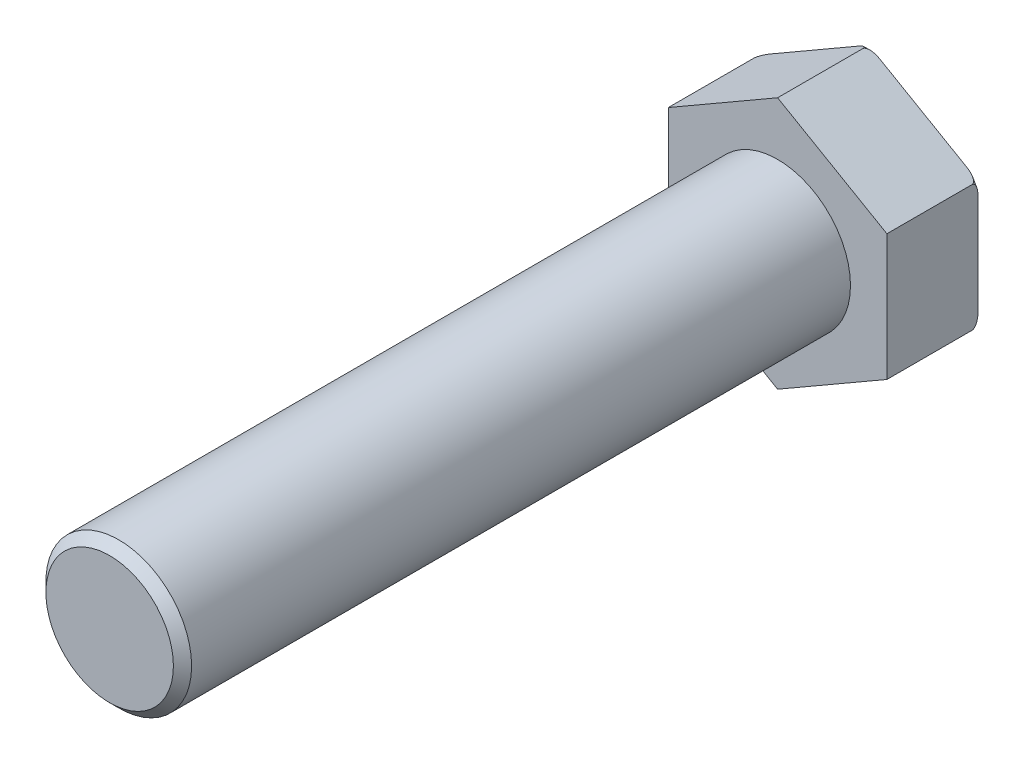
ISO-10303-21;
HEADER;
FILE_DESCRIPTION(('STEP AP214'),'2;1');
FILE_NAME('part.step','',(''),(''),'','','');
FILE_SCHEMA(('AUTOMOTIVE_DESIGN { 1 0 10303 214 1 1 1 1 }'));
ENDSEC;
DATA;
#1=APPLICATION_CONTEXT('core data for automotive mechanical design processes');
#2=APPLICATION_PROTOCOL_DEFINITION('international standard','automotive_design',2000,#1);
#3=PRODUCT_CONTEXT('',#1,'mechanical');
#4=PRODUCT('Part','Part','',(#3));
#5=PRODUCT_RELATED_PRODUCT_CATEGORY('part','',(#4));
#6=PRODUCT_DEFINITION_FORMATION('','',#4);
#7=PRODUCT_DEFINITION_CONTEXT('part definition',#1,'design');
#8=PRODUCT_DEFINITION('design','',#6,#7);
#9=PRODUCT_DEFINITION_SHAPE('','',#8);
#10=(LENGTH_UNIT() NAMED_UNIT(*) SI_UNIT(.MILLI.,.METRE.));
#11=(NAMED_UNIT(*) PLANE_ANGLE_UNIT() SI_UNIT($,.RADIAN.));
#12=(NAMED_UNIT(*) SI_UNIT($,.STERADIAN.) SOLID_ANGLE_UNIT());
#13=UNCERTAINTY_MEASURE_WITH_UNIT(LENGTH_MEASURE(1.E-05),#10,'distance_accuracy_value','');
#14=(GEOMETRIC_REPRESENTATION_CONTEXT(3) GLOBAL_UNCERTAINTY_ASSIGNED_CONTEXT((#13)) GLOBAL_UNIT_ASSIGNED_CONTEXT((#10,
#11,#12)) REPRESENTATION_CONTEXT('',''));
#15=CARTESIAN_POINT('',(0.,0.,0.));
#16=DIRECTION('',(0.,0.,1.));
#17=DIRECTION('',(1.,0.,0.));
#18=AXIS2_PLACEMENT_3D('',#15,#16,#17);
#19=CARTESIAN_POINT('',(0.,20.7846096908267,15.));
#20=DIRECTION('',(0.,0.,1.));
#21=DIRECTION('',(1.,0.,0.));
#22=AXIS2_PLACEMENT_3D('',#19,#20,#21);
#23=PLANE('',#22);
#24=DIRECTION('',(-0.866025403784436,-0.5,0.));
#25=VECTOR('',#24,1.);
#26=CARTESIAN_POINT('',(-18.,10.3923048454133,15.));
#27=LINE('',#26,#25);
#28=CARTESIAN_POINT('',(0.,20.7846096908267,15.));
#29=VERTEX_POINT('',#28);
#30=CARTESIAN_POINT('',(-18.,10.3923048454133,15.));
#31=VERTEX_POINT('',#30);
#32=EDGE_CURVE('E190',#29,#31,#27,.T.);
#33=ORIENTED_EDGE('',*,*,#32,.T.);
#34=DIRECTION('',(0.,-1.,0.));
#35=VECTOR('',#34,1.);
#36=CARTESIAN_POINT('',(-18.,10.3923048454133,15.));
#37=LINE('',#36,#35);
#38=CARTESIAN_POINT('',(-18.,-10.3923048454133,15.));
#39=VERTEX_POINT('',#38);
#40=EDGE_CURVE('E193',#31,#39,#37,.T.);
#41=ORIENTED_EDGE('',*,*,#40,.T.);
#42=DIRECTION('',(0.866025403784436,-0.5,0.));
#43=VECTOR('',#42,1.);
#44=CARTESIAN_POINT('',(-18.,-10.3923048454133,15.));
#45=LINE('',#44,#43);
#46=CARTESIAN_POINT('',(0.,-20.7846096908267,15.));
#47=VERTEX_POINT('',#46);
#48=EDGE_CURVE('E198',#39,#47,#45,.T.);
#49=ORIENTED_EDGE('',*,*,#48,.T.);
#50=DIRECTION('',(0.866025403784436,0.5,0.));
#51=VECTOR('',#50,1.);
#52=CARTESIAN_POINT('',(18.,-10.3923048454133,15.));
#53=LINE('',#52,#51);
#54=CARTESIAN_POINT('',(18.,-10.3923048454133,15.));
#55=VERTEX_POINT('',#54);
#56=EDGE_CURVE('E209',#47,#55,#53,.T.);
#57=ORIENTED_EDGE('',*,*,#56,.T.);
#58=DIRECTION('',(0.,1.,0.));
#59=VECTOR('',#58,1.);
#60=CARTESIAN_POINT('',(18.,10.3923048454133,15.));
#61=LINE('',#60,#59);
#62=CARTESIAN_POINT('',(18.,10.3923048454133,15.));
#63=VERTEX_POINT('',#62);
#64=EDGE_CURVE('E211',#55,#63,#61,.T.);
#65=ORIENTED_EDGE('',*,*,#64,.T.);
#66=DIRECTION('',(-0.866025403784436,0.5,0.));
#67=VECTOR('',#66,1.);
#68=CARTESIAN_POINT('',(18.,10.3923048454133,15.));
#69=LINE('',#68,#67);
#70=EDGE_CURVE('E131',#63,#29,#69,.T.);
#71=ORIENTED_EDGE('',*,*,#70,.T.);
#72=EDGE_LOOP('',(#33,#41,#49,#57,#65,#71));
#73=FACE_BOUND('',#72,.T.);
#74=CARTESIAN_POINT('',(0.,0.,15.));
#75=DIRECTION('',(0.,0.,1.));
#76=DIRECTION('',(1.,0.,0.));
#77=AXIS2_PLACEMENT_3D('',#74,#75,#76);
#78=CIRCLE('',#77,12.);
#79=CARTESIAN_POINT('',(12.,0.,15.));
#80=VERTEX_POINT('',#79);
#81=EDGE_CURVE('E306',#80,#80,#78,.T.);
#82=ORIENTED_EDGE('',*,*,#81,.F.);
#83=EDGE_LOOP('',(#82));
#84=FACE_BOUND('',#83,.T.);
#85=ADVANCED_FACE('F17',(#73,#84),#23,.T.);
#86=CARTESIAN_POINT('',(-18.,10.3923048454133,15.));
#87=DIRECTION('',(0.5,-0.866025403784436,0.));
#88=DIRECTION('',(0.866025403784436,0.5,0.));
#89=AXIS2_PLACEMENT_3D('',#86,#87,#88);
#90=PLANE('',#89);
#91=CARTESIAN_POINT('',(-4.34745537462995,18.2746051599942,1.0002));
#92=CARTESIAN_POINT('',(-4.34752819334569,18.2745631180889,0.980745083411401));
#93=CARTESIAN_POINT('',(-4.34576252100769,18.2755825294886,0.961396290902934));
#94=CARTESIAN_POINT('',(-4.33915392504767,18.2793980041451,0.9237202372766));
#95=CARTESIAN_POINT('',(-4.33436094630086,18.2821652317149,0.905381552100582));
#96=CARTESIAN_POINT('',(-4.3206821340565,18.2900626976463,0.86523372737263));
#97=CARTESIAN_POINT('',(-4.31105363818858,18.2956217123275,0.843771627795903));
#98=CARTESIAN_POINT('',(-4.2889693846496,18.3083720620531,0.802763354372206));
#99=CARTESIAN_POINT('',(-4.27649460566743,18.3155743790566,0.783231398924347));
#100=CARTESIAN_POINT('',(-4.23858341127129,18.3374624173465,0.730644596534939));
#101=CARTESIAN_POINT('',(-4.21094836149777,18.3534175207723,0.699737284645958));
#102=CARTESIAN_POINT('',(-4.15244135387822,18.3871965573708,0.642474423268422));
#103=CARTESIAN_POINT('',(-4.12156295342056,18.4050242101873,0.616128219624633));
#104=CARTESIAN_POINT('',(-4.03944613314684,18.4524343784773,0.552460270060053));
#105=CARTESIAN_POINT('',(-3.98677716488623,18.4828428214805,0.517623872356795));
#106=CARTESIAN_POINT('',(-3.87893286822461,18.5451067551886,0.453484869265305));
#107=CARTESIAN_POINT('',(-3.82375203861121,18.57696542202,0.424195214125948));
#108=CARTESIAN_POINT('',(-3.71155342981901,18.6417433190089,0.369658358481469));
#109=CARTESIAN_POINT('',(-3.6545269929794,18.6746675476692,0.3444350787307));
#110=CARTESIAN_POINT('',(-3.53950250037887,18.7410769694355,0.297420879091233));
#111=CARTESIAN_POINT('',(-3.48150546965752,18.7745615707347,0.275626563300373));
#112=CARTESIAN_POINT('',(-3.35759210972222,18.8461029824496,0.232434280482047));
#113=CARTESIAN_POINT('',(-3.2915775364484,18.8842165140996,0.211413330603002));
#114=CARTESIAN_POINT('',(-3.15883817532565,18.9608536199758,0.172591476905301));
#115=CARTESIAN_POINT('',(-3.09211325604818,18.9993772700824,0.154791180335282));
#116=CARTESIAN_POINT('',(-2.89098171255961,19.115500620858,0.105793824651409));
#117=CARTESIAN_POINT('',(-2.75574699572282,19.1935784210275,0.0790437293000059));
#118=CARTESIAN_POINT('',(-2.48463111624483,19.3501072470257,0.0368492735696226));
#119=CARTESIAN_POINT('',(-2.34875592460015,19.4285548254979,0.0213526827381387));
#120=CARTESIAN_POINT('',(-2.07648074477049,19.5857529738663,0.0020010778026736));
#121=CARTESIAN_POINT('',(-1.94008141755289,19.6645031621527,-0.00186556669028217));
#122=CARTESIAN_POINT('',(-1.70325910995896,19.8012325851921,0.00282361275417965));
#123=CARTESIAN_POINT('',(-1.60278990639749,19.8592385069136,0.00838532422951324));
#124=CARTESIAN_POINT('',(-1.40218590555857,19.9750572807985,0.0277102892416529));
#125=CARTESIAN_POINT('',(-1.3020522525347,20.0328694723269,0.0414907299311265));
#126=CARTESIAN_POINT('',(-1.14167783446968,20.1254616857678,0.0716110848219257));
#127=CARTESIAN_POINT('',(-1.08100399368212,20.1604917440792,0.0848935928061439));
#128=CARTESIAN_POINT('',(-0.960466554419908,20.2300840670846,0.115656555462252));
#129=CARTESIAN_POINT('',(-0.900602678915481,20.2646464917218,0.133135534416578));
#130=CARTESIAN_POINT('',(-0.782298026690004,20.3329497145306,0.172900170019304));
#131=CARTESIAN_POINT('',(-0.723852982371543,20.3666929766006,0.195168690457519));
#132=CARTESIAN_POINT('',(-0.608869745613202,20.4330785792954,0.245436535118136));
#133=CARTESIAN_POINT('',(-0.552329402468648,20.4657221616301,0.273429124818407));
#134=CARTESIAN_POINT('',(-0.457759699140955,20.5203220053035,0.327517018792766));
#135=CARTESIAN_POINT('',(-0.419008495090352,20.5426950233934,0.351919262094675));
#136=CARTESIAN_POINT('',(-0.343650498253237,20.5862029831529,0.404980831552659));
#137=CARTESIAN_POINT('',(-0.307046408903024,20.6073363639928,0.433645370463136));
#138=CARTESIAN_POINT('',(-0.236747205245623,20.6479236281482,0.49622863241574));
#139=CARTESIAN_POINT('',(-0.203083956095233,20.6673591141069,0.530195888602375));
#140=CARTESIAN_POINT('',(-0.1408682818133,20.7032793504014,0.603931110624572));
#141=CARTESIAN_POINT('',(-0.112302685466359,20.719771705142,0.643683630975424));
#142=CARTESIAN_POINT('',(-0.0722593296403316,20.7428907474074,0.713192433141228));
#143=CARTESIAN_POINT('',(-0.0583912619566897,20.7508974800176,0.741104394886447));
#144=CARTESIAN_POINT('',(-0.0345989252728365,20.7646339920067,0.799043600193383));
#145=CARTESIAN_POINT('',(-0.0246630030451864,20.7703704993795,0.829064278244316));
#146=CARTESIAN_POINT('',(-0.0115234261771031,20.7779566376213,0.88259972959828));
#147=CARTESIAN_POINT('',(-0.00723852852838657,20.7804305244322,0.905761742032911));
#148=CARTESIAN_POINT('',(-0.00145215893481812,20.7837712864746,0.952669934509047));
#149=CARTESIAN_POINT('',(3.39663611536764E-05,20.7846293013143,0.976418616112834));
#150=CARTESIAN_POINT('',(-3.46410169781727E-08,20.7846096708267,1.0002));
#151=B_SPLINE_CURVE_WITH_KNOTS('',3,(#91,#92,#93,#94,#95,#96,#97,#98,#99,#100,#101,#102,#103,
#104,#105,#106,#107,#108,#109,#110,#111,#112,#113,#114,#115,#116,#117,#118,#119,#120,#121,#122,
#123,#124,#125,#126,#127,#128,#129,#130,#131,#132,#133,#134,#135,#136,#137,#138,#139,#140,#141,
#142,#143,#144,#145,#146,#147,#148,#149,#150),.UNSPECIFIED.,.F.,.F.,(4,2,2,2,2,2,2,2,2,2,2,2,2,
2,2,2,2,2,2,2,2,2,2,2,2,2,2,2,2,4),(0.,0.058084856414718,0.115235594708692,0.187336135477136,
0.259933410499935,0.392462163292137,0.52525933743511,0.734999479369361,0.945223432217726,
1.15664216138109,1.36785017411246,1.60498316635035,1.84216082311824,2.31697932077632,
2.78957972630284,3.26170735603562,3.60991736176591,3.95885811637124,4.17267947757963,
4.38642575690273,4.59941964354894,4.81216436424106,4.96488425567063,5.1177924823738,
5.27219253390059,5.42618768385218,5.52241359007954,5.61835214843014,5.68919053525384,
5.76041623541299),.UNSPECIFIED.);
#152=CARTESIAN_POINT('',(-1.88852438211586,19.6942696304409,0.));
#153=VERTEX_POINT('',#152);
#154=CARTESIAN_POINT('',(0.,20.7846096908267,1.));
#155=VERTEX_POINT('',#154);
#156=EDGE_CURVE('E115',#153,#155,#151,.T.);
#157=ORIENTED_EDGE('',*,*,#156,.F.);
#158=DIRECTION('',(-0.866025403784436,-0.5,0.));
#159=VECTOR('',#158,1.);
#160=CARTESIAN_POINT('',(-18.,10.3923048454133,0.));
#161=LINE('',#160,#159);
#162=CARTESIAN_POINT('',(-16.1114756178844,11.4826449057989,0.));
#163=VERTEX_POINT('',#162);
#164=EDGE_CURVE('E214',#153,#163,#161,.T.);
#165=ORIENTED_EDGE('',*,*,#164,.T.);
#166=CARTESIAN_POINT('',(-17.9999999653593,10.3923048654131,1.0002));
#167=CARTESIAN_POINT('',(-18.0000731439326,10.3922626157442,0.970001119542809));
#168=CARTESIAN_POINT('',(-17.997654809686,10.3936588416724,0.939891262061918));
#169=CARTESIAN_POINT('',(-17.9884060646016,10.3989986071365,0.880895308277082));
#170=CARTESIAN_POINT('',(-17.9816212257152,10.402915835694,0.851999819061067));
#171=CARTESIAN_POINT('',(-17.9622662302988,10.4140904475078,0.789628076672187));
#172=CARTESIAN_POINT('',(-17.9487496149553,10.4218942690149,0.756548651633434));
#173=CARTESIAN_POINT('',(-17.9172308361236,10.440091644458,0.69328271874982));
#174=CARTESIAN_POINT('',(-17.8992102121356,10.4504958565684,0.663108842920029));
#175=CARTESIAN_POINT('',(-17.8497052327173,10.4790775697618,0.591051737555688));
#176=CARTESIAN_POINT('',(-17.8160705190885,10.4984965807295,0.551156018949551));
#177=CARTESIAN_POINT('',(-17.7440381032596,10.5400845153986,0.477658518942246));
#178=CARTESIAN_POINT('',(-17.7056302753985,10.5622592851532,0.444070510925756));
#179=CARTESIAN_POINT('',(-17.6292662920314,10.6063480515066,0.384962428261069));
#180=CARTESIAN_POINT('',(-17.5915664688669,10.6281140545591,0.358992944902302));
#181=CARTESIAN_POINT('',(-17.5143752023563,10.672680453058,0.310852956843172));
#182=CARTESIAN_POINT('',(-17.4748822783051,10.6954817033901,0.288685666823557));
#183=CARTESIAN_POINT('',(-17.3544662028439,10.7650039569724,0.227052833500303));
#184=CARTESIAN_POINT('',(-17.2716597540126,10.8128122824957,0.192495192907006));
#185=CARTESIAN_POINT('',(-17.101945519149,10.9107968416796,0.132938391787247));
#186=CARTESIAN_POINT('',(-17.0149899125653,10.9610006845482,0.108130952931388));
#187=CARTESIAN_POINT('',(-16.8395304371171,11.0623022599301,0.0669497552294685));
#188=CARTESIAN_POINT('',(-16.7510250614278,11.1134008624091,0.0505847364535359));
#189=CARTESIAN_POINT('',(-16.5728653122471,11.2162614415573,0.0249092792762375));
#190=CARTESIAN_POINT('',(-16.4832075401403,11.2680253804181,0.0156313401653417));
#191=CARTESIAN_POINT('',(-16.3035653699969,11.3717418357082,0.00331241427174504));
#192=CARTESIAN_POINT('',(-16.2135808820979,11.4236944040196,0.000273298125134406));
#193=CARTESIAN_POINT('',(-15.9685359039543,11.5651711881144,-0.000424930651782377));
#194=CARTESIAN_POINT('',(-15.8134430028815,11.6547141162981,0.00739133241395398));
#195=CARTESIAN_POINT('',(-15.581705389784,11.7885078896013,0.0301085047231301));
#196=CARTESIAN_POINT('',(-15.5046048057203,11.8330219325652,0.0395139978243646));
#197=CARTESIAN_POINT('',(-15.3507946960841,11.9218242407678,0.0619382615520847));
#198=CARTESIAN_POINT('',(-15.2740851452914,11.9661125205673,0.0749567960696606));
#199=CARTESIAN_POINT('',(-15.1216499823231,12.054121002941,0.104546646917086));
#200=CARTESIAN_POINT('',(-15.0459212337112,12.0978430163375,0.121096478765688));
#201=CARTESIAN_POINT('',(-14.8951533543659,12.1848888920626,0.157965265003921));
#202=CARTESIAN_POINT('',(-14.8201141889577,12.2282127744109,0.178284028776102));
#203=CARTESIAN_POINT('',(-14.6711154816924,12.3142372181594,0.223012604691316));
#204=CARTESIAN_POINT('',(-14.5971540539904,12.3569388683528,0.247414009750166));
#205=CARTESIAN_POINT('',(-14.4505502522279,12.4415806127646,0.300994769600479));
#206=CARTESIAN_POINT('',(-14.3779072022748,12.4835210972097,0.330171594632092));
#207=CARTESIAN_POINT('',(-14.283943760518,12.537770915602,0.372419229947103));
#208=CARTESIAN_POINT('',(-14.2616965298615,12.5506153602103,0.382761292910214));
#209=CARTESIAN_POINT('',(-14.2174380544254,12.5761680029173,0.404101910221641));
#210=CARTESIAN_POINT('',(-14.1954268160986,12.5888761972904,0.415100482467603));
#211=CARTESIAN_POINT('',(-14.1297277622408,12.6268075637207,0.449228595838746));
#212=CARTESIAN_POINT('',(-14.086462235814,12.6517869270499,0.473451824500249));
#213=CARTESIAN_POINT('',(-13.9976616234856,12.7030559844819,0.528038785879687));
#214=CARTESIAN_POINT('',(-13.9522860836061,12.7292535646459,0.558763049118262));
#215=CARTESIAN_POINT('',(-13.8870225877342,12.7669334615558,0.609527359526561));
#216=CARTESIAN_POINT('',(-13.8657609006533,12.7792089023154,0.62720209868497));
#217=CARTESIAN_POINT('',(-13.8245604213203,12.8029960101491,0.664483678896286));
#218=CARTESIAN_POINT('',(-13.804620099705,12.8145085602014,0.684088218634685));
#219=CARTESIAN_POINT('',(-13.7705124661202,12.834200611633,0.721513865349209));
#220=CARTESIAN_POINT('',(-13.7559908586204,12.842584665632,0.738900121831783));
#221=CARTESIAN_POINT('',(-13.7287342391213,12.8583212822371,0.775498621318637));
#222=CARTESIAN_POINT('',(-13.7159994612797,12.865673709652,0.794711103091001));
#223=CARTESIAN_POINT('',(-13.6948998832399,12.8778555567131,0.832093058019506));
#224=CARTESIAN_POINT('',(-13.6861653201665,12.8828984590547,0.849979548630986));
#225=CARTESIAN_POINT('',(-13.6713380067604,12.8914590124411,0.887124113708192));
#226=CARTESIAN_POINT('',(-13.6652344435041,12.8949829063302,0.906376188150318));
#227=CARTESIAN_POINT('',(-13.6581132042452,12.8990943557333,0.938177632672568));
#228=CARTESIAN_POINT('',(-13.6560404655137,12.9002910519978,0.950414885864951));
#229=CARTESIAN_POINT('',(-13.6532422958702,12.9019065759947,0.975161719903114));
#230=CARTESIAN_POINT('',(-13.6525245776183,12.9023209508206,0.98767245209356));
#231=CARTESIAN_POINT('',(-13.6525446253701,12.9023093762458,1.00019999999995));
#232=B_SPLINE_CURVE_WITH_KNOTS('',3,(#166,#167,#168,#169,#170,#171,#172,#173,#174,#175,#176,
#177,#178,#179,#180,#181,#182,#183,#184,#185,#186,#187,#188,#189,#190,#191,#192,#193,#194,#195,
#196,#197,#198,#199,#200,#201,#202,#203,#204,#205,#206,#207,#208,#209,#210,#211,#212,#213,#214,
#215,#216,#217,#218,#219,#220,#221,#222,#223,#224,#225,#226,#227,#228,#229,#230,#231),
.UNSPECIFIED.,.F.,.F.,(4,2,2,2,2,2,2,2,2,2,2,2,2,2,2,2,2,2,2,2,2,2,2,2,2,2,2,2,2,2,2,2,4),(0.,
0.0903207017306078,0.179713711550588,0.2888395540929,0.398420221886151,0.564519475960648,
0.730977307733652,0.882822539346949,1.03479552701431,1.33895971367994,1.64883681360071,
1.95903407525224,2.27064541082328,2.58235016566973,3.11932174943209,3.38784259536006,
3.65634589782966,3.92325996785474,4.19016054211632,4.45651812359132,4.72273505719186,
4.8058056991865,4.88887860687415,5.05534893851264,5.23719713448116,5.32788260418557,
5.41846121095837,5.49081455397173,5.56317736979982,5.62457678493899,5.68572139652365,
5.72303483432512,5.76056002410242),.UNSPECIFIED.);
#233=CARTESIAN_POINT('',(-18.,10.3923048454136,1.));
#234=VERTEX_POINT('',#233);
#235=EDGE_CURVE('E201',#234,#163,#232,.T.);
#236=ORIENTED_EDGE('',*,*,#235,.F.);
#237=DIRECTION('',(0.,0.,-1.));
#238=VECTOR('',#237,1.);
#239=CARTESIAN_POINT('',(-18.,10.3923048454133,15.));
#240=LINE('',#239,#238);
#241=EDGE_CURVE('E147',#31,#234,#240,.T.);
#242=ORIENTED_EDGE('',*,*,#241,.F.);
#243=ORIENTED_EDGE('',*,*,#32,.F.);
#244=DIRECTION('',(0.,0.,-1.));
#245=VECTOR('',#244,1.);
#246=CARTESIAN_POINT('',(0.,20.7846096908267,15.));
#247=LINE('',#246,#245);
#248=EDGE_CURVE('E133',#29,#155,#247,.T.);
#249=ORIENTED_EDGE('',*,*,#248,.T.);
#250=EDGE_LOOP('',(#157,#165,#236,#242,#243,#249));
#251=FACE_BOUND('',#250,.T.);
#252=ADVANCED_FACE('F294',(#251),#90,.F.);
#253=CARTESIAN_POINT('',(-18.,10.3923048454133,15.));
#254=DIRECTION('',(1.,0.,0.));
#255=DIRECTION('',(0.,1.,0.));
#256=AXIS2_PLACEMENT_3D('',#253,#254,#255);
#257=PLANE('',#256);
#258=CARTESIAN_POINT('',(-18.000000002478,-10.0892892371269,0.473477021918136));
#259=CARTESIAN_POINT('',(-18.0000000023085,-10.0560407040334,0.447231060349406));
#260=CARTESIAN_POINT('',(-18.0000000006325,-10.0214496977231,0.422719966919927));
#261=CARTESIAN_POINT('',(-17.999999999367,-9.95029474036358,0.376728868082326));
#262=CARTESIAN_POINT('',(-17.9999999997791,-9.91372936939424,0.355251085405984));
#263=CARTESIAN_POINT('',(-18.0000000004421,-9.80183742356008,0.294772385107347));
#264=CARTESIAN_POINT('',(-18.0000000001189,-9.72435668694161,0.259756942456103));
#265=CARTESIAN_POINT('',(-17.9999999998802,-9.56566867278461,0.197873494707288));
#266=CARTESIAN_POINT('',(-17.9999999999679,-9.48443759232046,0.171069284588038));
#267=CARTESIAN_POINT('',(-18.0000000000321,-9.319964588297,0.124337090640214));
#268=CARTESIAN_POINT('',(-18.0000000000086,-9.23672076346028,0.104415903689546));
#269=CARTESIAN_POINT('',(-17.9999999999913,-9.06894590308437,0.0703485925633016));
#270=CARTESIAN_POINT('',(-17.9999999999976,-8.98441300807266,0.0562118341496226));
#271=CARTESIAN_POINT('',(-18.0000000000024,-8.81464894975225,0.0329617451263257));
#272=CARTESIAN_POINT('',(-18.0000000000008,-8.72941756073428,0.0238501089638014));
#273=CARTESIAN_POINT('',(-17.9999999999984,-8.47890951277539,0.00361129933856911));
#274=CARTESIAN_POINT('',(-17.9999999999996,-8.31313036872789,-0.00146730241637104));
#275=CARTESIAN_POINT('',(-18.0000000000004,-7.98162978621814,0.00217384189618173));
#276=CARTESIAN_POINT('',(-18.0000000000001,-7.81590864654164,0.0109098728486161));
#277=CARTESIAN_POINT('',(-17.9999999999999,-7.48488117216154,0.0409621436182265));
#278=CARTESIAN_POINT('',(-18.,-7.31957960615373,0.0623317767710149));
#279=CARTESIAN_POINT('',(-18.,-7.07333620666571,0.103780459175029));
#280=CARTESIAN_POINT('',(-18.,-6.99157719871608,0.119153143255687));
#281=CARTESIAN_POINT('',(-18.,-6.82874963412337,0.15318393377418));
#282=CARTESIAN_POINT('',(-18.,-6.74768098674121,0.17184160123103));
#283=CARTESIAN_POINT('',(-18.,-6.58483081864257,0.21312618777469));
#284=CARTESIAN_POINT('',(-18.,-6.50306734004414,0.235824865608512));
#285=CARTESIAN_POINT('',(-18.,-6.34074831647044,0.285496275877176));
#286=CARTESIAN_POINT('',(-18.,-6.26019410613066,0.312473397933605));
#287=CARTESIAN_POINT('',(-18.,-6.101732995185,0.371356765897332));
#288=CARTESIAN_POINT('',(-18.,-6.02380805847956,0.403212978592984));
#289=CARTESIAN_POINT('',(-18.,-5.90937552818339,0.456137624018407));
#290=CARTESIAN_POINT('',(-18.,-5.87167218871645,0.474617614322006));
#291=CARTESIAN_POINT('',(-18.,-5.79737768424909,0.513678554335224));
#292=CARTESIAN_POINT('',(-18.,-5.76078597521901,0.534258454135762));
#293=CARTESIAN_POINT('',(-18.,-5.69328858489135,0.575562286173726));
#294=CARTESIAN_POINT('',(-18.,-5.66221052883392,0.596001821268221));
#295=CARTESIAN_POINT('',(-18.,-5.60178464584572,0.639623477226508));
#296=CARTESIAN_POINT('',(-18.,-5.57244523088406,0.66281752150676));
#297=CARTESIAN_POINT('',(-18.,-5.51630612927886,0.71307347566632));
#298=CARTESIAN_POINT('',(-18.,-5.48955875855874,0.740195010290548));
#299=CARTESIAN_POINT('',(-18.,-5.44169257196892,0.79900098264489));
#300=CARTESIAN_POINT('',(-18.,-5.42052809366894,0.830644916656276));
#301=CARTESIAN_POINT('',(-18.,-5.39691871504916,0.880373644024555));
#302=CARTESIAN_POINT('',(-18.,-5.39053419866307,0.896566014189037));
#303=CARTESIAN_POINT('',(-18.,-5.38044141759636,0.929767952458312));
#304=CARTESIAN_POINT('',(-18.,-5.37672995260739,0.946776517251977));
#305=CARTESIAN_POINT('',(-18.,-5.37238378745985,0.981301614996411));
#306=CARTESIAN_POINT('',(-18.,-5.37176819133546,0.998820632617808));
#307=CARTESIAN_POINT('',(-18.,-5.37374657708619,1.03367941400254));
#308=CARTESIAN_POINT('',(-18.,-5.37634252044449,1.05101906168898));
#309=CARTESIAN_POINT('',(-18.,-5.38501093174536,1.08744475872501));
#310=CARTESIAN_POINT('',(-18.,-5.39153060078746,1.10642224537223));
#311=CARTESIAN_POINT('',(-18.,-5.40755655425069,1.14306321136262));
#312=CARTESIAN_POINT('',(-18.,-5.41706838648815,1.16072417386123));
#313=CARTESIAN_POINT('',(-18.,-5.44484201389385,1.20514340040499));
#314=CARTESIAN_POINT('',(-18.,-5.46487796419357,1.23077642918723));
#315=CARTESIAN_POINT('',(-18.,-5.50838389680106,1.27891436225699));
#316=CARTESIAN_POINT('',(-18.,-5.5318642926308,1.30140936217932));
#317=CARTESIAN_POINT('',(-18.,-5.59018645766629,1.35187967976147));
#318=CARTESIAN_POINT('',(-18.,-5.62598209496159,1.37873817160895));
#319=CARTESIAN_POINT('',(-18.,-5.69994653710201,1.42900968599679));
#320=CARTESIAN_POINT('',(-18.,-5.73812014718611,1.45241538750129));
#321=CARTESIAN_POINT('',(-18.,-5.81616656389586,1.49666096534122));
#322=CARTESIAN_POINT('',(-18.,-5.85604697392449,1.51748729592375));
#323=CARTESIAN_POINT('',(-18.,-5.93681401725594,1.55695809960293));
#324=CARTESIAN_POINT('',(-18.,-5.97769968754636,1.57560456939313));
#325=CARTESIAN_POINT('',(-18.,-6.08222534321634,1.62057682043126));
#326=CARTESIAN_POINT('',(-18.,-6.1463814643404,1.6457003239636));
#327=CARTESIAN_POINT('',(-18.,-6.2759114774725,1.6926166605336));
#328=CARTESIAN_POINT('',(-18.,-6.34128589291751,1.71440802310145));
#329=CARTESIAN_POINT('',(-18.,-6.47301805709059,1.75518756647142));
#330=CARTESIAN_POINT('',(-18.,-6.53937725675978,1.77417103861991));
#331=CARTESIAN_POINT('',(-18.,-6.67277056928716,1.80960936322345));
#332=CARTESIAN_POINT('',(-18.,-6.73980477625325,1.82606385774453));
#333=CARTESIAN_POINT('',(-18.,-6.94203702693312,1.87202578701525));
#334=CARTESIAN_POINT('',(-18.,-7.07804190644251,1.89803450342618));
#335=CARTESIAN_POINT('',(-18.,-7.35125151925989,1.94140808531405));
#336=CARTESIAN_POINT('',(-18.,-7.48845485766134,1.95878191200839));
#337=CARTESIAN_POINT('',(-18.,-7.77460527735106,1.98586713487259));
#338=CARTESIAN_POINT('',(-18.,-7.92362192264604,1.99486277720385));
#339=CARTESIAN_POINT('',(-18.,-8.22209529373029,2.00186372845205));
#340=CARTESIAN_POINT('',(-18.,-8.37155232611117,1.99985665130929));
#341=CARTESIAN_POINT('',(-18.,-8.6690765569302,1.9831444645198));
#342=CARTESIAN_POINT('',(-18.,-8.8171469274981,1.96850642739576));
#343=CARTESIAN_POINT('',(-18.,-9.03732967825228,1.93488408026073));
#344=CARTESIAN_POINT('',(-18.,-9.11034740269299,1.92174715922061));
#345=CARTESIAN_POINT('',(-18.,-9.25542921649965,1.89102123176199));
#346=CARTESIAN_POINT('',(-18.,-9.32749374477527,1.87343435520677));
#347=CARTESIAN_POINT('',(-18.,-9.44966300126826,1.838871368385));
#348=CARTESIAN_POINT('',(-18.,-9.50012869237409,1.8231713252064));
#349=CARTESIAN_POINT('',(-18.,-9.60005744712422,1.78877470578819));
#350=CARTESIAN_POINT('',(-18.,-9.64952020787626,1.77007723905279));
#351=CARTESIAN_POINT('',(-18.,-9.74682053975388,1.72933375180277));
#352=CARTESIAN_POINT('',(-18.,-9.79466399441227,1.70730192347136));
#353=CARTESIAN_POINT('',(-18.,-9.88830949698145,1.65929810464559));
#354=CARTESIAN_POINT('',(-18.,-9.934113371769,1.63332973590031));
#355=CARTESIAN_POINT('',(-18.,-10.0177162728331,1.57998913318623));
#356=CARTESIAN_POINT('',(-18.,-10.0558313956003,1.55311797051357));
#357=CARTESIAN_POINT('',(-18.,-10.1288342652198,1.4951064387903));
#358=CARTESIAN_POINT('',(-18.,-10.1637163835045,1.46395885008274));
#359=CARTESIAN_POINT('',(-18.,-10.2290999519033,1.39638386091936));
#360=CARTESIAN_POINT('',(-18.,-10.2595309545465,1.3598867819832));
#361=CARTESIAN_POINT('',(-18.,-10.3128305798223,1.28174452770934));
#362=CARTESIAN_POINT('',(-18.0000000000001,-10.3357319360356,1.24012274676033));
#363=CARTESIAN_POINT('',(-18.,-10.3642584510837,1.16911734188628));
#364=CARTESIAN_POINT('',(-17.9999999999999,-10.3731417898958,1.14104164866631));
#365=CARTESIAN_POINT('',(-18.0000000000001,-10.3860999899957,1.08379576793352));
#366=CARTESIAN_POINT('',(-18.0000000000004,-10.3901788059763,1.05462650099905));
#367=CARTESIAN_POINT('',(-17.9999999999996,-10.3931520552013,0.99594223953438));
#368=CARTESIAN_POINT('',(-17.9999999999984,-10.3920326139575,0.966426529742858));
#369=CARTESIAN_POINT('',(-18.0000000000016,-10.3846884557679,0.908036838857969));
#370=CARTESIAN_POINT('',(-18.0000000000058,-10.3784612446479,0.879163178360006));
#371=CARTESIAN_POINT('',(-17.9999999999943,-10.3616615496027,0.823500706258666));
#372=CARTESIAN_POINT('',(-17.999999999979,-10.3511979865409,0.796678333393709));
#373=CARTESIAN_POINT('',(-18.000000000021,-10.3266507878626,0.744767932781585));
#374=CARTESIAN_POINT('',(-18.0000000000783,-10.312565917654,0.719680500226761));
#375=CARTESIAN_POINT('',(-17.9999999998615,-10.2695300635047,0.652823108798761));
#376=CARTESIAN_POINT('',(-17.9999999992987,-10.2374742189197,0.613053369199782));
#377=CARTESIAN_POINT('',(-18.000000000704,-10.1673720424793,0.539162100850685));
#378=CARTESIAN_POINT('',(-18.000000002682,-10.1293028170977,0.505063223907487));
#379=CARTESIAN_POINT('',(-18.000000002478,-10.0892892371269,0.473477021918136));
#380=B_SPLINE_CURVE_WITH_KNOTS('',3,(#258,#259,#260,#261,#262,#263,#264,#265,#266,#267,#268,
#269,#270,#271,#272,#273,#274,#275,#276,#277,#278,#279,#280,#281,#282,#283,#284,#285,#286,#287,
#288,#289,#290,#291,#292,#293,#294,#295,#296,#297,#298,#299,#300,#301,#302,#303,#304,#305,#306,
#307,#308,#309,#310,#311,#312,#313,#314,#315,#316,#317,#318,#319,#320,#321,#322,#323,#324,#325,
#326,#327,#328,#329,#330,#331,#332,#333,#334,#335,#336,#337,#338,#339,#340,#341,#342,#343,#344,
#345,#346,#347,#348,#349,#350,#351,#352,#353,#354,#355,#356,#357,#358,#359,#360,#361,#362,#363,
#364,#365,#366,#367,#368,#369,#370,#371,#372,#373,#374,#375,#376,#377,#378,#379),.UNSPECIFIED.,
.T.,.F.,(4,2,2,2,2,2,2,2,2,2,2,2,2,2,2,2,2,2,2,2,2,2,2,2,2,2,2,2,2,2,2,2,2,2,2,2,2,2,2,2,2,2,2,
2,2,2,2,2,2,2,2,2,2,2,2,2,2,2,2,2,4),(0.,0.127006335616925,0.254105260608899,0.508457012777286,
0.764737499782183,1.02127034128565,1.27821691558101,1.5352500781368,2.0320521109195,
2.52944021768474,3.02894561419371,3.27846834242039,3.52795775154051,3.78242431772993,
4.0371536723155,4.28942699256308,4.41534506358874,4.54120048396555,4.652694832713,
4.76469071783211,4.87861144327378,4.99156929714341,5.04360127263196,5.09557084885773,
5.14786072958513,5.20018256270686,5.26004662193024,5.32002233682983,5.41707350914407,
5.51442438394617,5.64835510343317,5.78256583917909,5.91745392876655,6.05221748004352,
6.25878893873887,6.46545129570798,6.6724563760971,6.87949072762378,7.29456846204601,
7.70921452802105,8.15669696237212,8.60468324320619,9.05030517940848,9.27277028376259,
9.49512911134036,9.65360666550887,9.81213138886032,9.96999942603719,10.1277230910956,
10.2673900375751,10.4072957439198,10.5492195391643,10.690517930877,10.7785021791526,
10.8664139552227,10.9545605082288,11.0427501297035,11.128803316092,11.2148858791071,
11.3671397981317,11.5199879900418),.UNSPECIFIED.);
#381=CARTESIAN_POINT('',(-18.0000000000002,-10.3923048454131,1.));
#382=VERTEX_POINT('',#381);
#383=CARTESIAN_POINT('',(-18.,-8.2116247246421,0.));
#384=VERTEX_POINT('',#383);
#385=EDGE_CURVE('E32',#382,#384,#380,.T.);
#386=ORIENTED_EDGE('',*,*,#385,.F.);
#387=DIRECTION('',(0.,0.,-1.));
#388=VECTOR('',#387,1.);
#389=CARTESIAN_POINT('',(-18.,-10.3923048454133,15.));
#390=LINE('',#389,#388);
#391=EDGE_CURVE('E144',#39,#382,#390,.T.);
#392=ORIENTED_EDGE('',*,*,#391,.F.);
#393=ORIENTED_EDGE('',*,*,#40,.F.);
#394=ORIENTED_EDGE('',*,*,#241,.T.);
#395=CARTESIAN_POINT('',(-17.9999995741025,5.37229565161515,1.));
#396=CARTESIAN_POINT('',(-17.9999995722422,5.37229577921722,0.980772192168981));
#397=CARTESIAN_POINT('',(-17.9999998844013,5.37426195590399,0.961543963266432));
#398=CARTESIAN_POINT('',(-18.0000001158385,5.38182384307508,0.923804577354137));
#399=CARTESIAN_POINT('',(-18.0000000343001,5.38742707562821,0.905294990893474));
#400=CARTESIAN_POINT('',(-17.9999999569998,5.40336484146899,0.864916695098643));
#401=CARTESIAN_POINT('',(-17.9999999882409,5.4145389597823,0.843386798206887));
#402=CARTESIAN_POINT('',(-18.0000000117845,5.44011112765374,0.802358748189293));
#403=CARTESIAN_POINT('',(-18.0000000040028,5.45451609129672,0.782865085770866));
#404=CARTESIAN_POINT('',(-17.9999999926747,5.49834653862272,0.73029266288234));
#405=CARTESIAN_POINT('',(-17.9999999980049,5.53031524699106,0.699367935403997));
#406=CARTESIAN_POINT('',(-18.0000000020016,5.59803144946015,0.642040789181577));
#407=CARTESIAN_POINT('',(-18.0000000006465,5.63379085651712,0.615653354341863));
#408=CARTESIAN_POINT('',(-17.9999999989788,5.72889362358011,0.551884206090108));
#409=CARTESIAN_POINT('',(-17.999999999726,5.78989198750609,0.516996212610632));
#410=CARTESIAN_POINT('',(-18.0000000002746,5.91478640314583,0.452769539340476));
#411=CARTESIAN_POINT('',(-18.0000000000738,5.97868881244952,0.423443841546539));
#412=CARTESIAN_POINT('',(-17.9999999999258,6.10859637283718,0.3688551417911));
#413=CARTESIAN_POINT('',(-17.9999999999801,6.17461095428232,0.343614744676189));
#414=CARTESIAN_POINT('',(-18.0000000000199,6.30776236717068,0.296574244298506));
#415=CARTESIAN_POINT('',(-18.0000000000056,6.37489801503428,0.27477073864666));
#416=CARTESIAN_POINT('',(-17.9999999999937,6.51833326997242,0.231567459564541));
#417=CARTESIAN_POINT('',(-17.9999999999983,6.59474635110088,0.210545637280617));
#418=CARTESIAN_POINT('',(-18.0000000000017,6.74839293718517,0.171731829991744));
#419=CARTESIAN_POINT('',(-18.0000000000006,6.82562659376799,0.153940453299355));
#420=CARTESIAN_POINT('',(-17.9999999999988,7.05843285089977,0.104985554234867));
#421=CARTESIAN_POINT('',(-17.9999999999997,7.21496192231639,0.0782846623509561));
#422=CARTESIAN_POINT('',(-18.0000000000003,7.52886986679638,0.0362246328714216));
#423=CARTESIAN_POINT('',(-18.0000000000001,7.68624284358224,0.0208205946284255));
#424=CARTESIAN_POINT('',(-17.9999999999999,8.00158691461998,0.00173713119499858));
#425=CARTESIAN_POINT('',(-18.,8.15955726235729,-0.0019538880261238));
#426=CARTESIAN_POINT('',(-18.,8.44566454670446,0.00335405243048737));
#427=CARTESIAN_POINT('',(-18.,8.57384286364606,0.0101038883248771));
#428=CARTESIAN_POINT('',(-18.,8.82937696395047,0.0337829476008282));
#429=CARTESIAN_POINT('',(-18.,8.95673252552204,0.0507148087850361));
#430=CARTESIAN_POINT('',(-18.,9.14644884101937,0.0855378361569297));
#431=CARTESIAN_POINT('',(-18.,9.2096730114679,0.0987753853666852));
#432=CARTESIAN_POINT('',(-18.,9.33525412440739,0.128840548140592));
#433=CARTESIAN_POINT('',(-18.,9.39761134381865,0.145666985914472));
#434=CARTESIAN_POINT('',(-18.,9.52115024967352,0.183470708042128));
#435=CARTESIAN_POINT('',(-18.,9.58233049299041,0.204452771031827));
#436=CARTESIAN_POINT('',(-18.,9.70278209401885,0.251265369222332));
#437=CARTESIAN_POINT('',(-18.,9.7620548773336,0.277092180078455));
#438=CARTESIAN_POINT('',(-18.,9.88992111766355,0.340570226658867));
#439=CARTESIAN_POINT('',(-18.,9.95786139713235,0.379565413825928));
#440=CARTESIAN_POINT('',(-18.,10.0862723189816,0.468226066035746));
#441=CARTESIAN_POINT('',(-18.,10.146787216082,0.517822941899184));
#442=CARTESIAN_POINT('',(-18.,10.2247164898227,0.59945462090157));
#443=CARTESIAN_POINT('',(-18.,10.2475960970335,0.626249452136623));
#444=CARTESIAN_POINT('',(-18.,10.2895626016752,0.68272618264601));
#445=CARTESIAN_POINT('',(-18.,10.3086485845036,0.712408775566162));
#446=CARTESIAN_POINT('',(-18.,10.3419747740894,0.774894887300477));
#447=CARTESIAN_POINT('',(-18.,10.3561547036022,0.807731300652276));
#448=CARTESIAN_POINT('',(-18.,10.3779246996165,0.875517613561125));
#449=CARTESIAN_POINT('',(-18.,10.3855274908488,0.910463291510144));
#450=CARTESIAN_POINT('',(-18.,10.3927820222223,0.977269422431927));
#451=CARTESIAN_POINT('',(-18.,10.3932189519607,1.00904451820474));
#452=CARTESIAN_POINT('',(-18.,10.3880962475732,1.07210892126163));
#453=CARTESIAN_POINT('',(-18.,10.3825350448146,1.10339809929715));
#454=CARTESIAN_POINT('',(-18.,10.3668260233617,1.16146180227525));
#455=CARTESIAN_POINT('',(-18.,10.3571839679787,1.18837743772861));
#456=CARTESIAN_POINT('',(-18.,10.3341949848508,1.2405535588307));
#457=CARTESIAN_POINT('',(-18.,10.3208472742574,1.2658136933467));
#458=CARTESIAN_POINT('',(-18.,10.2819362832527,1.32958385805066));
#459=CARTESIAN_POINT('',(-18.,10.2539297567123,1.366600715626));
#460=CARTESIAN_POINT('',(-18.,10.192519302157,1.43585750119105));
#461=CARTESIAN_POINT('',(-18.,10.1590988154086,1.46808217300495));
#462=CARTESIAN_POINT('',(-18.,10.0637550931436,1.54945724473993));
#463=CARTESIAN_POINT('',(-18.,9.9983606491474,1.59450481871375));
#464=CARTESIAN_POINT('',(-18.,9.86189832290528,1.67477203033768));
#465=CARTESIAN_POINT('',(-18.,9.79081777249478,1.70996889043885));
#466=CARTESIAN_POINT('',(-18.,9.64606520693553,1.77223162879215));
#467=CARTESIAN_POINT('',(-18.,9.57242559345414,1.7993741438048));
#468=CARTESIAN_POINT('',(-18.,9.42310223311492,1.84740141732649));
#469=CARTESIAN_POINT('',(-18.,9.34741658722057,1.86828012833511));
#470=CARTESIAN_POINT('',(-18.,9.19462854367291,1.90479329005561));
#471=CARTESIAN_POINT('',(-18.,9.1175233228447,1.92041574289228));
#472=CARTESIAN_POINT('',(-18.,8.96251493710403,1.94708032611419));
#473=CARTESIAN_POINT('',(-18.,8.88461149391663,1.95812079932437));
#474=CARTESIAN_POINT('',(-18.,8.65103327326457,1.9851152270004));
#475=CARTESIAN_POINT('',(-18.,8.4946592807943,1.99512578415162));
#476=CARTESIAN_POINT('',(-18.,8.18155241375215,2.00208126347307));
#477=CARTESIAN_POINT('',(-18.,8.0248193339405,1.99901203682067));
#478=CARTESIAN_POINT('',(-18.,7.71213850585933,1.98130731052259));
#479=CARTESIAN_POINT('',(-17.9999999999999,7.55619027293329,1.96668014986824));
#480=CARTESIAN_POINT('',(-18.0000000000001,7.2458234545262,1.92647958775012));
#481=CARTESIAN_POINT('',(-18.0000000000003,7.09140374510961,1.90091495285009));
#482=CARTESIAN_POINT('',(-17.9999999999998,6.84369442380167,1.85032145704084));
#483=CARTESIAN_POINT('',(-17.9999999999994,6.7496697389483,1.82884613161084));
#484=CARTESIAN_POINT('',(-18.0000000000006,6.56297832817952,1.78112756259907));
#485=CARTESIAN_POINT('',(-18.0000000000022,6.47030965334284,1.75489208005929));
#486=CARTESIAN_POINT('',(-17.9999999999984,6.31346662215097,1.70524187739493));
#487=CARTESIAN_POINT('',(-17.9999999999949,6.24885008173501,1.68322912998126));
#488=CARTESIAN_POINT('',(-18.0000000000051,6.1207475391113,1.63578636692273));
#489=CARTESIAN_POINT('',(-18.0000000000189,6.05726371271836,1.610350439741));
#490=CARTESIAN_POINT('',(-17.9999999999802,5.92926054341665,1.55397337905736));
#491=CARTESIAN_POINT('',(-17.9999999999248,5.8648253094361,1.52283455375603));
#492=CARTESIAN_POINT('',(-18.0000000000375,5.77089370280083,1.47133966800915));
#493=CARTESIAN_POINT('',(-18.0000000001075,5.74007430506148,1.45340285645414));
#494=CARTESIAN_POINT('',(-17.9999999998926,5.67968293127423,1.41555376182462));
#495=CARTESIAN_POINT('',(-17.9999999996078,5.6501100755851,1.39564290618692));
#496=CARTESIAN_POINT('',(-18.0000000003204,5.59802822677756,1.35719937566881));
#497=CARTESIAN_POINT('',(-18.0000000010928,5.57521650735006,1.33908065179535));
#498=CARTESIAN_POINT('',(-17.9999999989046,5.53130146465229,1.30074287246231));
#499=CARTESIAN_POINT('',(-17.9999999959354,5.51020225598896,1.28051901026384));
#500=CARTESIAN_POINT('',(-18.0000000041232,5.47040554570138,1.23723316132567));
#501=CARTESIAN_POINT('',(-18.0000000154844,5.45174702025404,1.21413448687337));
#502=CARTESIAN_POINT('',(-17.9999999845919,5.41892183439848,1.16493273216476));
#503=CARTESIAN_POINT('',(-17.9999999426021,5.4047334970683,1.13884501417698));
#504=CARTESIAN_POINT('',(-18.0000000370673,5.38708756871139,1.09364407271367));
#505=CARTESIAN_POINT('',(-18.0000001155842,5.38160917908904,1.07533344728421));
#506=CARTESIAN_POINT('',(-17.9999998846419,5.37421663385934,1.03801439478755));
#507=CARTESIAN_POINT('',(-17.9999995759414,5.37229552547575,1.01900740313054));
#508=CARTESIAN_POINT('',(-17.9999995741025,5.37229565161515,1.));
#509=B_SPLINE_CURVE_WITH_KNOTS('',3,(#395,#396,#397,#398,#399,#400,#401,#402,#403,#404,#405,
#406,#407,#408,#409,#410,#411,#412,#413,#414,#415,#416,#417,#418,#419,#420,#421,#422,#423,#424,
#425,#426,#427,#428,#429,#430,#431,#432,#433,#434,#435,#436,#437,#438,#439,#440,#441,#442,#443,
#444,#445,#446,#447,#448,#449,#450,#451,#452,#453,#454,#455,#456,#457,#458,#459,#460,#461,#462,
#463,#464,#465,#466,#467,#468,#469,#470,#471,#472,#473,#474,#475,#476,#477,#478,#479,#480,#481,
#482,#483,#484,#485,#486,#487,#488,#489,#490,#491,#492,#493,#494,#495,#496,#497,#498,#499,#500,
#501,#502,#503,#504,#505,#506,#507,#508),.UNSPECIFIED.,.T.,.F.,(4,2,2,2,2,2,2,2,2,2,2,2,2,2,2,2,
2,2,2,2,2,2,2,2,2,2,2,2,2,2,2,2,2,2,2,2,2,2,2,2,2,2,2,2,2,2,2,2,2,2,2,2,2,2,2,2,4),(0.,
0.0575932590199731,0.115306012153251,0.187657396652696,0.260165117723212,0.392856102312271,
0.525977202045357,0.736265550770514,0.947038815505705,1.1589411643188,1.37063240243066,
1.60830386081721,1.8460200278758,2.3219161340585,2.79591033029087,3.26943520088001,
3.65419446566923,4.03905345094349,4.23275610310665,4.42639539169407,4.620258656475,
4.81397349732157,5.04832599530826,5.28120587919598,5.38665863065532,5.49213677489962,
5.59886831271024,5.70539289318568,5.80015618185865,5.89494425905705,5.98039528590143,
6.06586437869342,6.20431538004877,6.34319812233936,6.58008566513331,6.81751651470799,
7.05260990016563,7.28792953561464,7.52378272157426,7.75972113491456,8.22905716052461,
8.69890101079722,9.16840618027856,9.63753573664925,9.92677485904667,10.2155465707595,
10.4202586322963,10.6253288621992,10.8397210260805,10.9466445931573,11.0534913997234,
11.1407967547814,11.2283060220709,11.3170759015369,11.4054084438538,11.4624531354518,
11.5193862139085),.UNSPECIFIED.);
#510=CARTESIAN_POINT('',(-18.,8.21162472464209,0.));
#511=VERTEX_POINT('',#510);
#512=EDGE_CURVE('E221',#511,#234,#509,.T.);
#513=ORIENTED_EDGE('',*,*,#512,.F.);
#514=DIRECTION('',(0.,-1.,0.));
#515=VECTOR('',#514,1.);
#516=CARTESIAN_POINT('',(-18.,10.3923048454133,0.));
#517=LINE('',#516,#515);
#518=EDGE_CURVE('E187',#511,#384,#517,.T.);
#519=ORIENTED_EDGE('',*,*,#518,.T.);
#520=EDGE_LOOP('',(#386,#392,#393,#394,#513,#519));
#521=FACE_BOUND('',#520,.T.);
#522=ADVANCED_FACE('F219',(#521),#257,.F.);
#523=CARTESIAN_POINT('',(-18.,-10.3923048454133,15.));
#524=DIRECTION('',(0.5,0.866025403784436,0.));
#525=DIRECTION('',(-0.866025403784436,0.5,0.));
#526=AXIS2_PLACEMENT_3D('',#523,#524,#525);
#527=PLANE('',#526);
#528=CARTESIAN_POINT('',(-3.46410194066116E-08,-20.7846096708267,1.0002));
#529=CARTESIAN_POINT('',(7.31439325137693E-05,-20.7846519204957,0.970001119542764));
#530=CARTESIAN_POINT('',(-0.00234519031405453,-20.7832556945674,0.939891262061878));
#531=CARTESIAN_POINT('',(-0.0115939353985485,-20.7779159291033,0.880895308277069));
#532=CARTESIAN_POINT('',(-0.0183787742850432,-20.7739987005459,0.851999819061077));
#533=CARTESIAN_POINT('',(-0.0377337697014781,-20.762824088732,0.789628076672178));
#534=CARTESIAN_POINT('',(-0.051250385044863,-20.7550202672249,0.756548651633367));
#535=CARTESIAN_POINT('',(-0.0827691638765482,-20.7368228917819,0.693282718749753));
#536=CARTESIAN_POINT('',(-0.100789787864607,-20.7264186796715,0.663108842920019));
#537=CARTESIAN_POINT('',(-0.150294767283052,-20.6978369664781,0.591051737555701));
#538=CARTESIAN_POINT('',(-0.183929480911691,-20.6784179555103,0.551156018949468));
#539=CARTESIAN_POINT('',(-0.255961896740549,-20.6368300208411,0.477658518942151));
#540=CARTESIAN_POINT('',(-0.294369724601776,-20.6146552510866,0.444070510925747));
#541=CARTESIAN_POINT('',(-0.370733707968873,-20.5705664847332,0.384962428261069));
#542=CARTESIAN_POINT('',(-0.408433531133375,-20.5488004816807,0.358992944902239));
#543=CARTESIAN_POINT('',(-0.485624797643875,-20.5042340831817,0.310852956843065));
#544=CARTESIAN_POINT('',(-0.525117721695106,-20.4814328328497,0.288685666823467));
#545=CARTESIAN_POINT('',(-0.6455337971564,-20.4119105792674,0.227052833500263));
#546=CARTESIAN_POINT('',(-0.728340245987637,-20.3641022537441,0.192495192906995));
#547=CARTESIAN_POINT('',(-0.898054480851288,-20.2661176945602,0.13293839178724));
#548=CARTESIAN_POINT('',(-0.985010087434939,-20.2159138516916,0.108130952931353));
#549=CARTESIAN_POINT('',(-1.16046956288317,-20.1146122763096,0.0669497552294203));
#550=CARTESIAN_POINT('',(-1.2489749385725,-20.0635136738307,0.0505847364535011));
#551=CARTESIAN_POINT('',(-1.4271346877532,-19.9606530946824,0.0249092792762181));
#552=CARTESIAN_POINT('',(-1.51679245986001,-19.9088891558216,0.0156313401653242));
#553=CARTESIAN_POINT('',(-1.69643463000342,-19.8051727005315,0.0033124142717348));
#554=CARTESIAN_POINT('',(-1.78641911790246,-19.7532201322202,0.000273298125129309));
#555=CARTESIAN_POINT('',(-2.0314640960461,-19.6117433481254,-0.000424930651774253));
#556=CARTESIAN_POINT('',(-2.18655699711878,-19.5222004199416,0.00739133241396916));
#557=CARTESIAN_POINT('',(-2.41829461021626,-19.3884066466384,0.0301085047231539));
#558=CARTESIAN_POINT('',(-2.49539519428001,-19.3438926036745,0.0395139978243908));
#559=CARTESIAN_POINT('',(-2.64920530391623,-19.255090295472,0.0619382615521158));
#560=CARTESIAN_POINT('',(-2.72591485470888,-19.2108020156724,0.0749567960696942));
#561=CARTESIAN_POINT('',(-2.87835001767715,-19.1227935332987,0.104546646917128));
#562=CARTESIAN_POINT('',(-2.95407876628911,-19.0790715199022,0.121096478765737));
#563=CARTESIAN_POINT('',(-3.10484664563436,-18.9920256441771,0.157965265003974));
#564=CARTESIAN_POINT('',(-3.17988581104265,-18.9487017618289,0.178284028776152));
#565=CARTESIAN_POINT('',(-3.32888451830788,-18.8626773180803,0.223012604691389));
#566=CARTESIAN_POINT('',(-3.40284594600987,-18.8199756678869,0.247414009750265));
#567=CARTESIAN_POINT('',(-3.54944974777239,-18.7353339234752,0.300994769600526));
#568=CARTESIAN_POINT('',(-3.62209279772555,-18.6933934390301,0.33017159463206));
#569=CARTESIAN_POINT('',(-3.71605623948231,-18.6391436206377,0.372419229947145));
#570=CARTESIAN_POINT('',(-3.73830347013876,-18.6262991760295,0.382761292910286));
#571=CARTESIAN_POINT('',(-3.78256194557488,-18.6007465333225,0.40410191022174));
#572=CARTESIAN_POINT('',(-3.80457318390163,-18.5880383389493,0.415100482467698));
#573=CARTESIAN_POINT('',(-3.87027223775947,-18.550106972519,0.449228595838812));
#574=CARTESIAN_POINT('',(-3.91353776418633,-18.5251276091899,0.47345182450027));
#575=CARTESIAN_POINT('',(-4.00233837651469,-18.4738585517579,0.528038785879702));
#576=CARTESIAN_POINT('',(-4.04771391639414,-18.4476609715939,0.558763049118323));
#577=CARTESIAN_POINT('',(-4.112977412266,-18.4099810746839,0.60952735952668));
#578=CARTESIAN_POINT('',(-4.13423909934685,-18.3977056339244,0.627202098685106));
#579=CARTESIAN_POINT('',(-4.17543957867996,-18.3739185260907,0.664483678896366));
#580=CARTESIAN_POINT('',(-4.19537990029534,-18.3624059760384,0.684088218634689));
#581=CARTESIAN_POINT('',(-4.22948753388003,-18.3427139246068,0.721513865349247));
#582=CARTESIAN_POINT('',(-4.24400914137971,-18.3343298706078,0.738900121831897));
#583=CARTESIAN_POINT('',(-4.2712657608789,-18.3185932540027,0.775498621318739));
#584=CARTESIAN_POINT('',(-4.28400053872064,-18.3112408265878,0.794711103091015));
#585=CARTESIAN_POINT('',(-4.30510011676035,-18.2990589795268,0.832093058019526));
#586=CARTESIAN_POINT('',(-4.31383467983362,-18.2940160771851,0.849979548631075));
#587=CARTESIAN_POINT('',(-4.32866199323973,-18.2854555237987,0.887124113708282));
#588=CARTESIAN_POINT('',(-4.33476555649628,-18.2819316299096,0.906376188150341));
#589=CARTESIAN_POINT('',(-4.34188679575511,-18.2778201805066,0.938177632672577));
#590=CARTESIAN_POINT('',(-4.3439595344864,-18.276623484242,0.950414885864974));
#591=CARTESIAN_POINT('',(-4.3467577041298,-18.2750079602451,0.975161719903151));
#592=CARTESIAN_POINT('',(-4.34747542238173,-18.2745935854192,0.987672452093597));
#593=CARTESIAN_POINT('',(-4.34745537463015,-18.2746051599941,1.00019999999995));
#594=B_SPLINE_CURVE_WITH_KNOTS('',3,(#528,#529,#530,#531,#532,#533,#534,#535,#536,#537,#538,
#539,#540,#541,#542,#543,#544,#545,#546,#547,#548,#549,#550,#551,#552,#553,#554,#555,#556,#557,
#558,#559,#560,#561,#562,#563,#564,#565,#566,#567,#568,#569,#570,#571,#572,#573,#574,#575,#576,
#577,#578,#579,#580,#581,#582,#583,#584,#585,#586,#587,#588,#589,#590,#591,#592,#593),
.UNSPECIFIED.,.F.,.F.,(4,2,2,2,2,2,2,2,2,2,2,2,2,2,2,2,2,2,2,2,2,2,2,2,2,2,2,2,2,2,2,2,4),(0.,
0.0903207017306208,0.179713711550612,0.288839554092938,0.398420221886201,0.564519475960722,
0.730977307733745,0.882822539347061,1.03479552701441,1.33895971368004,1.64883681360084,
1.95903407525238,2.27064541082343,2.58235016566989,3.11932174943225,3.38784259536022,
3.65634589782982,3.9232599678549,4.19016054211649,4.45651812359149,4.72273505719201,
4.80580569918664,4.88887860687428,5.05534893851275,5.23719713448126,5.32788260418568,
5.41846121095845,5.49081455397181,5.5631773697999,5.62457678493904,5.68572139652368,
5.72303483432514,5.76056002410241),.UNSPECIFIED.);
#595=CARTESIAN_POINT('',(0.,-20.7846096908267,1.));
#596=VERTEX_POINT('',#595);
#597=CARTESIAN_POINT('',(-1.88852438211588,-19.6942696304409,0.));
#598=VERTEX_POINT('',#597);
#599=EDGE_CURVE('E40',#596,#598,#594,.T.);
#600=ORIENTED_EDGE('',*,*,#599,.F.);
#601=DIRECTION('',(0.,0.,-1.));
#602=VECTOR('',#601,1.);
#603=CARTESIAN_POINT('',(0.,-20.7846096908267,15.));
#604=LINE('',#603,#602);
#605=EDGE_CURVE('E136',#47,#596,#604,.T.);
#606=ORIENTED_EDGE('',*,*,#605,.F.);
#607=ORIENTED_EDGE('',*,*,#48,.F.);
#608=ORIENTED_EDGE('',*,*,#391,.T.);
#609=CARTESIAN_POINT('',(-13.6525446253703,-12.9023093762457,1.0002));
#610=CARTESIAN_POINT('',(-13.6524718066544,-12.9023514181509,0.980745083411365));
#611=CARTESIAN_POINT('',(-13.6542374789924,-12.9013320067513,0.9613962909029));
#612=CARTESIAN_POINT('',(-13.6608460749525,-12.8975165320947,0.923720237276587));
#613=CARTESIAN_POINT('',(-13.6656390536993,-12.894749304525,0.905381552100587));
#614=CARTESIAN_POINT('',(-13.6793178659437,-12.8868518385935,0.865233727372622));
#615=CARTESIAN_POINT('',(-13.6889463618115,-12.8812928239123,0.843771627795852));
#616=CARTESIAN_POINT('',(-13.7110306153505,-12.8685424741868,0.802763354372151));
#617=CARTESIAN_POINT('',(-13.7235053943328,-12.8613401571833,0.783231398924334));
#618=CARTESIAN_POINT('',(-13.761416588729,-12.8394521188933,0.730644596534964));
#619=CARTESIAN_POINT('',(-13.7890516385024,-12.8234970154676,0.699737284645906));
#620=CARTESIAN_POINT('',(-13.8475586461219,-12.789717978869,0.642474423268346));
#621=CARTESIAN_POINT('',(-13.8784370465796,-12.7718903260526,0.616128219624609));
#622=CARTESIAN_POINT('',(-13.9605538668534,-12.7244801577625,0.552460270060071));
#623=CARTESIAN_POINT('',(-14.013222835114,-12.6940717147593,0.517623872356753));
#624=CARTESIAN_POINT('',(-14.1210671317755,-12.6318077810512,0.453484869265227));
#625=CARTESIAN_POINT('',(-14.176247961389,-12.5999491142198,0.42419521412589));
#626=CARTESIAN_POINT('',(-14.2884465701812,-12.5351712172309,0.369658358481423));
#627=CARTESIAN_POINT('',(-14.3454730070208,-12.5022469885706,0.344435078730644));
#628=CARTESIAN_POINT('',(-14.4604974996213,-12.4358375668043,0.297420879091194));
#629=CARTESIAN_POINT('',(-14.5184945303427,-12.4023529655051,0.275626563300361));
#630=CARTESIAN_POINT('',(-14.642407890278,-12.3308115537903,0.232434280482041));
#631=CARTESIAN_POINT('',(-14.7084224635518,-12.2926980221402,0.211413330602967));
#632=CARTESIAN_POINT('',(-14.8411618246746,-12.2160609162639,0.172591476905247));
#633=CARTESIAN_POINT('',(-14.9078867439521,-12.1775372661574,0.154791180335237));
#634=CARTESIAN_POINT('',(-15.1090182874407,-12.0614139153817,0.105793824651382));
#635=CARTESIAN_POINT('',(-15.2442530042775,-11.9833361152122,0.0790437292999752));
#636=CARTESIAN_POINT('',(-15.5153688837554,-11.826807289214,0.0368492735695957));
#637=CARTESIAN_POINT('',(-15.6512440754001,-11.7483597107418,0.0213526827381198));
#638=CARTESIAN_POINT('',(-15.9235192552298,-11.5911615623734,0.00200107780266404));
#639=CARTESIAN_POINT('',(-16.0599185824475,-11.5124113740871,-0.00186556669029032));
#640=CARTESIAN_POINT('',(-16.2967408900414,-11.3756819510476,0.0028236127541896));
#641=CARTESIAN_POINT('',(-16.3972100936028,-11.3176760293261,0.00838532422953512));
#642=CARTESIAN_POINT('',(-16.5978140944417,-11.2018572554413,0.0277102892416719));
#643=CARTESIAN_POINT('',(-16.6979477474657,-11.144045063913,0.0414907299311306));
#644=CARTESIAN_POINT('',(-16.8583221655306,-11.051452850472,0.0716110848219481));
#645=CARTESIAN_POINT('',(-16.9189960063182,-11.0164227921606,0.084893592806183));
#646=CARTESIAN_POINT('',(-17.0395334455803,-10.9468304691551,0.115656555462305));
#647=CARTESIAN_POINT('',(-17.0993973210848,-10.9122680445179,0.133135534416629));
#648=CARTESIAN_POINT('',(-17.2177019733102,-10.8439648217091,0.172900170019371));
#649=CARTESIAN_POINT('',(-17.2761470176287,-10.8102215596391,0.195168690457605));
#650=CARTESIAN_POINT('',(-17.3911302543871,-10.7438359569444,0.245436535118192));
#651=CARTESIAN_POINT('',(-17.4476705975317,-10.7111923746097,0.273429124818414));
#652=CARTESIAN_POINT('',(-17.5422403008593,-10.6565925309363,0.327517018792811));
#653=CARTESIAN_POINT('',(-17.5809915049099,-10.6342195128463,0.351919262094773));
#654=CARTESIAN_POINT('',(-17.656349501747,-10.5907115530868,0.404980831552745));
#655=CARTESIAN_POINT('',(-17.6929535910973,-10.569578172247,0.433645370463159));
#656=CARTESIAN_POINT('',(-17.7632527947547,-10.5289909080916,0.496228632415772));
#657=CARTESIAN_POINT('',(-17.7969160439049,-10.5095554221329,0.530195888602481));
#658=CARTESIAN_POINT('',(-17.8591317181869,-10.4736351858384,0.603931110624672));
#659=CARTESIAN_POINT('',(-17.887697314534,-10.4571428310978,0.643683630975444));
#660=CARTESIAN_POINT('',(-17.9277406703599,-10.4340237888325,0.713192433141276));
#661=CARTESIAN_POINT('',(-17.9416087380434,-10.4260170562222,0.741104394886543));
#662=CARTESIAN_POINT('',(-17.9654010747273,-10.4122805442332,0.799043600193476));
#663=CARTESIAN_POINT('',(-17.9753369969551,-10.4065440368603,0.829064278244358));
#664=CARTESIAN_POINT('',(-17.9884765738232,-10.3989578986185,0.882599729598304));
#665=CARTESIAN_POINT('',(-17.9927614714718,-10.3964840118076,0.905761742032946));
#666=CARTESIAN_POINT('',(-17.9985478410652,-10.3931432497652,0.952669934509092));
#667=CARTESIAN_POINT('',(-18.0000339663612,-10.3922852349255,0.976418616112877));
#668=CARTESIAN_POINT('',(-17.9999999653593,-10.3923048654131,1.0002));
#669=B_SPLINE_CURVE_WITH_KNOTS('',3,(#609,#610,#611,#612,#613,#614,#615,#616,#617,#618,#619,
#620,#621,#622,#623,#624,#625,#626,#627,#628,#629,#630,#631,#632,#633,#634,#635,#636,#637,#638,
#639,#640,#641,#642,#643,#644,#645,#646,#647,#648,#649,#650,#651,#652,#653,#654,#655,#656,#657,
#658,#659,#660,#661,#662,#663,#664,#665,#666,#667,#668),.UNSPECIFIED.,.F.,.F.,(4,2,2,2,2,2,2,2,
2,2,2,2,2,2,2,2,2,2,2,2,2,2,2,2,2,2,2,2,2,4),(0.,0.0580848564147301,0.115235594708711,
0.187336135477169,0.259933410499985,0.392462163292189,0.52525933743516,0.734999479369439,
0.945223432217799,1.15664216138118,1.36785017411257,1.60498316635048,1.84216082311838,
2.31697932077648,2.78957972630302,3.26170735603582,3.6099173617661,3.95885811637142,
4.1726794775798,4.38642575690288,4.5994196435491,4.8121643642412,4.96488425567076,
5.11779248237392,5.27219253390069,5.42618768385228,5.52241359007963,5.61835214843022,
5.68919053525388,5.76041623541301),.UNSPECIFIED.);
#670=CARTESIAN_POINT('',(-16.1114756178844,-11.4826449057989,0.));
#671=VERTEX_POINT('',#670);
#672=EDGE_CURVE('E225',#671,#382,#669,.T.);
#673=ORIENTED_EDGE('',*,*,#672,.F.);
#674=DIRECTION('',(0.866025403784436,-0.5,0.));
#675=VECTOR('',#674,1.);
#676=CARTESIAN_POINT('',(-18.,-10.3923048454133,0.));
#677=LINE('',#676,#675);
#678=EDGE_CURVE('E183',#671,#598,#677,.T.);
#679=ORIENTED_EDGE('',*,*,#678,.T.);
#680=EDGE_LOOP('',(#600,#606,#607,#608,#673,#679));
#681=FACE_BOUND('',#680,.T.);
#682=ADVANCED_FACE('F224',(#681),#527,.F.);
#683=CARTESIAN_POINT('',(18.,-10.3923048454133,15.));
#684=DIRECTION('',(-0.5,0.866025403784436,0.));
#685=DIRECTION('',(-0.866025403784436,-0.5,0.));
#686=AXIS2_PLACEMENT_3D('',#683,#684,#685);
#687=PLANE('',#686);
#688=CARTESIAN_POINT('',(17.9999999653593,-10.3923048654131,1.0002));
#689=CARTESIAN_POINT('',(18.0000731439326,-10.3922626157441,0.970001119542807));
#690=CARTESIAN_POINT('',(17.997654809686,-10.3936588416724,0.939891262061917));
#691=CARTESIAN_POINT('',(17.9884060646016,-10.3989986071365,0.880895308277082));
#692=CARTESIAN_POINT('',(17.9816212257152,-10.402915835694,0.851999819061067));
#693=CARTESIAN_POINT('',(17.9622662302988,-10.4140904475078,0.789628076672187));
#694=CARTESIAN_POINT('',(17.9487496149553,-10.421894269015,0.756548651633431));
#695=CARTESIAN_POINT('',(17.9172308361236,-10.440091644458,0.693282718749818));
#696=CARTESIAN_POINT('',(17.8992102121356,-10.4504958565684,0.663108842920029));
#697=CARTESIAN_POINT('',(17.8497052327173,-10.4790775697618,0.591051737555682));
#698=CARTESIAN_POINT('',(17.8160705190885,-10.4984965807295,0.551156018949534));
#699=CARTESIAN_POINT('',(17.7440381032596,-10.5400845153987,0.477658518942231));
#700=CARTESIAN_POINT('',(17.7056302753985,-10.5622592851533,0.444070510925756));
#701=CARTESIAN_POINT('',(17.6292662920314,-10.6063480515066,0.384962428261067));
#702=CARTESIAN_POINT('',(17.5915664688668,-10.6281140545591,0.358992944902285));
#703=CARTESIAN_POINT('',(17.5143752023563,-10.6726804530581,0.310852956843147));
#704=CARTESIAN_POINT('',(17.4748822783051,-10.6954817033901,0.288685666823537));
#705=CARTESIAN_POINT('',(17.3544662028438,-10.7650039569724,0.227052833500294));
#706=CARTESIAN_POINT('',(17.2716597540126,-10.8128122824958,0.192495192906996));
#707=CARTESIAN_POINT('',(17.101945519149,-10.9107968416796,0.132938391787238));
#708=CARTESIAN_POINT('',(17.0149899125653,-10.9610006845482,0.108130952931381));
#709=CARTESIAN_POINT('',(16.8395304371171,-11.0623022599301,0.0669497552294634));
#710=CARTESIAN_POINT('',(16.7510250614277,-11.1134008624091,0.0505847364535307));
#711=CARTESIAN_POINT('',(16.572865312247,-11.2162614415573,0.0249092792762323));
#712=CARTESIAN_POINT('',(16.4832075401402,-11.2680253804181,0.0156313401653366));
#713=CARTESIAN_POINT('',(16.3035653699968,-11.3717418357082,0.00331241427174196));
#714=CARTESIAN_POINT('',(16.2135808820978,-11.4236944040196,0.00027329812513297));
#715=CARTESIAN_POINT('',(15.9685359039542,-11.5651711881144,-0.000424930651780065));
#716=CARTESIAN_POINT('',(15.8134430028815,-11.6547141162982,0.00739133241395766));
#717=CARTESIAN_POINT('',(15.581705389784,-11.7885078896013,0.0301085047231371));
#718=CARTESIAN_POINT('',(15.5046048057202,-11.8330219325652,0.0395139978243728));
#719=CARTESIAN_POINT('',(15.350794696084,-11.9218242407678,0.0619382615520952));
#720=CARTESIAN_POINT('',(15.2740851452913,-11.9661125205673,0.0749567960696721));
#721=CARTESIAN_POINT('',(15.1216499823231,-12.054121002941,0.1045466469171));
#722=CARTESIAN_POINT('',(15.0459212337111,-12.0978430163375,0.121096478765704));
#723=CARTESIAN_POINT('',(14.8951533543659,-12.1848888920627,0.157965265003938));
#724=CARTESIAN_POINT('',(14.8201141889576,-12.2282127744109,0.178284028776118));
#725=CARTESIAN_POINT('',(14.6711154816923,-12.3142372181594,0.223012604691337));
#726=CARTESIAN_POINT('',(14.5971540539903,-12.3569388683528,0.247414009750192));
#727=CARTESIAN_POINT('',(14.4505502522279,-12.4415806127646,0.3009947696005));
#728=CARTESIAN_POINT('',(14.3779072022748,-12.4835210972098,0.330171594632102));
#729=CARTESIAN_POINT('',(14.2839437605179,-12.5377709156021,0.372419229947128));
#730=CARTESIAN_POINT('',(14.2616965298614,-12.5506153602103,0.382761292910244));
#731=CARTESIAN_POINT('',(14.2174380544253,-12.5761680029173,0.404101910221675));
#732=CARTESIAN_POINT('',(14.1954268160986,-12.5888761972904,0.415100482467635));
#733=CARTESIAN_POINT('',(14.1297277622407,-12.6268075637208,0.449228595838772));
#734=CARTESIAN_POINT('',(14.0864622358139,-12.6517869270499,0.473451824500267));
#735=CARTESIAN_POINT('',(13.9976616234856,-12.7030559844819,0.528038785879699));
#736=CARTESIAN_POINT('',(13.9522860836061,-12.7292535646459,0.558763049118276));
#737=CARTESIAN_POINT('',(13.8870225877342,-12.7669334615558,0.609527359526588));
#738=CARTESIAN_POINT('',(13.8657609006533,-12.7792089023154,0.627202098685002));
#739=CARTESIAN_POINT('',(13.8245604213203,-12.8029960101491,0.664483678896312));
#740=CARTESIAN_POINT('',(13.804620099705,-12.8145085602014,0.684088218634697));
#741=CARTESIAN_POINT('',(13.7705124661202,-12.834200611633,0.721513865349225));
#742=CARTESIAN_POINT('',(13.7559908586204,-12.842584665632,0.738900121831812));
#743=CARTESIAN_POINT('',(13.7287342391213,-12.8583212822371,0.77549862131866));
#744=CARTESIAN_POINT('',(13.7159994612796,-12.865673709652,0.794711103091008));
#745=CARTESIAN_POINT('',(13.6948998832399,-12.8778555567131,0.832093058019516));
#746=CARTESIAN_POINT('',(13.6861653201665,-12.8828984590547,0.84997954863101));
#747=CARTESIAN_POINT('',(13.6713380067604,-12.8914590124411,0.887124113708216));
#748=CARTESIAN_POINT('',(13.665234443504,-12.8949829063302,0.906376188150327));
#749=CARTESIAN_POINT('',(13.6581132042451,-12.8990943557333,0.938177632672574));
#750=CARTESIAN_POINT('',(13.6560404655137,-12.9002910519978,0.950414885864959));
#751=CARTESIAN_POINT('',(13.6532422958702,-12.9019065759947,0.975161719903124));
#752=CARTESIAN_POINT('',(13.6525245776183,-12.9023209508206,0.98767245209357));
#753=CARTESIAN_POINT('',(13.6525446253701,-12.9023093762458,1.00019999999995));
#754=B_SPLINE_CURVE_WITH_KNOTS('',3,(#688,#689,#690,#691,#692,#693,#694,#695,#696,#697,#698,
#699,#700,#701,#702,#703,#704,#705,#706,#707,#708,#709,#710,#711,#712,#713,#714,#715,#716,#717,
#718,#719,#720,#721,#722,#723,#724,#725,#726,#727,#728,#729,#730,#731,#732,#733,#734,#735,#736,
#737,#738,#739,#740,#741,#742,#743,#744,#745,#746,#747,#748,#749,#750,#751,#752,#753),
.UNSPECIFIED.,.F.,.F.,(4,2,2,2,2,2,2,2,2,2,2,2,2,2,2,2,2,2,2,2,2,2,2,2,2,2,2,2,2,2,2,2,4),(0.,
0.0903207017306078,0.179713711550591,0.288839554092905,0.398420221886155,0.564519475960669,
0.730977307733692,0.882822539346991,1.03479552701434,1.33895971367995,1.64883681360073,
1.95903407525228,2.27064541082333,2.58235016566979,3.11932174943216,3.38784259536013,
3.65634589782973,3.92325996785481,4.1901605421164,4.4565181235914,4.72273505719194,
4.80580569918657,4.88887860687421,5.05534893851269,5.23719713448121,5.32788260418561,
5.4184612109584,5.49081455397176,5.56317736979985,5.62457678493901,5.68572139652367,
5.72303483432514,5.76056002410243),.UNSPECIFIED.);
#755=CARTESIAN_POINT('',(18.,-10.3923048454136,1.));
#756=VERTEX_POINT('',#755);
#757=CARTESIAN_POINT('',(16.1114756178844,-11.4826449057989,0.));
#758=VERTEX_POINT('',#757);
#759=EDGE_CURVE('E179',#756,#758,#754,.T.);
#760=ORIENTED_EDGE('',*,*,#759,.F.);
#761=DIRECTION('',(0.,0.,-1.));
#762=VECTOR('',#761,1.);
#763=CARTESIAN_POINT('',(18.,-10.3923048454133,15.));
#764=LINE('',#763,#762);
#765=EDGE_CURVE('E132',#55,#756,#764,.T.);
#766=ORIENTED_EDGE('',*,*,#765,.F.);
#767=ORIENTED_EDGE('',*,*,#56,.F.);
#768=ORIENTED_EDGE('',*,*,#605,.T.);
#769=CARTESIAN_POINT('',(4.34745537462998,-18.2746051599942,1.0002));
#770=CARTESIAN_POINT('',(4.34752819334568,-18.2745631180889,0.98074508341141));
#771=CARTESIAN_POINT('',(4.34576252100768,-18.2755825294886,0.961396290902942));
#772=CARTESIAN_POINT('',(4.33915392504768,-18.2793980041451,0.923720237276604));
#773=CARTESIAN_POINT('',(4.33436094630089,-18.2821652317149,0.905381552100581));
#774=CARTESIAN_POINT('',(4.32068213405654,-18.2900626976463,0.865233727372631));
#775=CARTESIAN_POINT('',(4.31105363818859,-18.2956217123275,0.843771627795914));
#776=CARTESIAN_POINT('',(4.28896938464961,-18.3083720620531,0.802763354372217));
#777=CARTESIAN_POINT('',(4.27649460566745,-18.3155743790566,0.78323139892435));
#778=CARTESIAN_POINT('',(4.23858341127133,-18.3374624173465,0.730644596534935));
#779=CARTESIAN_POINT('',(4.21094836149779,-18.3534175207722,0.69973728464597));
#780=CARTESIAN_POINT('',(4.15244135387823,-18.3871965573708,0.642474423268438));
#781=CARTESIAN_POINT('',(4.12156295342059,-18.4050242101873,0.616128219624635));
#782=CARTESIAN_POINT('',(4.03944613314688,-18.4524343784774,0.552460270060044));
#783=CARTESIAN_POINT('',(3.98677716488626,-18.4828428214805,0.517623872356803));
#784=CARTESIAN_POINT('',(3.87893286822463,-18.5451067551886,0.453484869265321));
#785=CARTESIAN_POINT('',(3.82375203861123,-18.57696542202,0.424195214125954));
#786=CARTESIAN_POINT('',(3.71155342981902,-18.6417433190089,0.369658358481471));
#787=CARTESIAN_POINT('',(3.65452699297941,-18.6746675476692,0.344435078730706));
#788=CARTESIAN_POINT('',(3.53950250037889,-18.7410769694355,0.297420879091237));
#789=CARTESIAN_POINT('',(3.48150546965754,-18.7745615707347,0.27562656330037));
#790=CARTESIAN_POINT('',(3.35759210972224,-18.8461029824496,0.232434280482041));
#791=CARTESIAN_POINT('',(3.29157753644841,-18.8842165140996,0.211413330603));
#792=CARTESIAN_POINT('',(3.15883817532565,-18.9608536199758,0.172591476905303));
#793=CARTESIAN_POINT('',(3.09211325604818,-18.9993772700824,0.154791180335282));
#794=CARTESIAN_POINT('',(2.89098171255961,-19.115500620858,0.105793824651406));
#795=CARTESIAN_POINT('',(2.75574699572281,-19.1935784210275,0.0790437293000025));
#796=CARTESIAN_POINT('',(2.48463111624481,-19.3501072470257,0.0368492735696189));
#797=CARTESIAN_POINT('',(2.34875592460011,-19.428554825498,0.0213526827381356));
#798=CARTESIAN_POINT('',(2.07648074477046,-19.5857529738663,0.00200107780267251));
#799=CARTESIAN_POINT('',(1.94008141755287,-19.6645031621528,-0.00186556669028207));
#800=CARTESIAN_POINT('',(1.70325910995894,-19.8012325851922,0.00282361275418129));
#801=CARTESIAN_POINT('',(1.60278990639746,-19.8592385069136,0.0083853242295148));
#802=CARTESIAN_POINT('',(1.40218590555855,-19.9750572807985,0.027710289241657));
#803=CARTESIAN_POINT('',(1.30205225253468,-20.0328694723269,0.0414907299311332));
#804=CARTESIAN_POINT('',(1.14167783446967,-20.1254616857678,0.0716110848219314));
#805=CARTESIAN_POINT('',(1.0810039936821,-20.1604917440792,0.0848935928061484));
#806=CARTESIAN_POINT('',(0.960466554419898,-20.2300840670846,0.115656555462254));
#807=CARTESIAN_POINT('',(0.900602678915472,-20.2646464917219,0.133135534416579));
#808=CARTESIAN_POINT('',(0.782298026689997,-20.3329497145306,0.172900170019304));
#809=CARTESIAN_POINT('',(0.723852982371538,-20.3666929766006,0.19516869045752));
#810=CARTESIAN_POINT('',(0.608869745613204,-20.4330785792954,0.245436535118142));
#811=CARTESIAN_POINT('',(0.552329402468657,-20.4657221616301,0.273429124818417));
#812=CARTESIAN_POINT('',(0.45775969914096,-20.5203220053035,0.32751701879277));
#813=CARTESIAN_POINT('',(0.419008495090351,-20.5426950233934,0.351919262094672));
#814=CARTESIAN_POINT('',(0.343650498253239,-20.5862029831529,0.404980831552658));
#815=CARTESIAN_POINT('',(0.307046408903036,-20.6073363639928,0.433645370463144));
#816=CARTESIAN_POINT('',(0.236747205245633,-20.6479236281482,0.496228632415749));
#817=CARTESIAN_POINT('',(0.203083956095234,-20.6673591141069,0.530195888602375));
#818=CARTESIAN_POINT('',(0.140868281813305,-20.7032793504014,0.603931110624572));
#819=CARTESIAN_POINT('',(0.112302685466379,-20.719771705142,0.643683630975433));
#820=CARTESIAN_POINT('',(0.0722593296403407,-20.7428907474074,0.713192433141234));
#821=CARTESIAN_POINT('',(0.0583912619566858,-20.7508974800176,0.741104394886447));
#822=CARTESIAN_POINT('',(0.0345989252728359,-20.7646339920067,0.799043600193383));
#823=CARTESIAN_POINT('',(0.0246630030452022,-20.7703704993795,0.829064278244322));
#824=CARTESIAN_POINT('',(0.011523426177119,-20.7779566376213,0.882599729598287));
#825=CARTESIAN_POINT('',(0.00723852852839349,-20.7804305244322,0.905761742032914));
#826=CARTESIAN_POINT('',(0.0014521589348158,-20.7837712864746,0.952669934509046));
#827=CARTESIAN_POINT('',(-3.3966361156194E-05,-20.7846293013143,0.976418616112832));
#828=CARTESIAN_POINT('',(3.46410324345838E-08,-20.7846096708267,1.0002));
#829=B_SPLINE_CURVE_WITH_KNOTS('',3,(#769,#770,#771,#772,#773,#774,#775,#776,#777,#778,#779,
#780,#781,#782,#783,#784,#785,#786,#787,#788,#789,#790,#791,#792,#793,#794,#795,#796,#797,#798,
#799,#800,#801,#802,#803,#804,#805,#806,#807,#808,#809,#810,#811,#812,#813,#814,#815,#816,#817,
#818,#819,#820,#821,#822,#823,#824,#825,#826,#827,#828),.UNSPECIFIED.,.F.,.F.,(4,2,2,2,2,2,2,2,
2,2,2,2,2,2,2,2,2,2,2,2,2,2,2,2,2,2,2,2,2,4),(0.,0.0580848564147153,0.115235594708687,
0.187336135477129,0.259933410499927,0.392462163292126,0.525259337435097,0.734999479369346,
0.945223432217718,1.15664216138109,1.36785017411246,1.60498316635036,1.84216082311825,
2.31697932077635,2.78957972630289,3.26170735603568,3.60991736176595,3.95885811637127,
4.17267947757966,4.38642575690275,4.59941964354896,4.81216436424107,4.96488425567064,
5.11779248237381,5.2721925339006,5.42618768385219,5.52241359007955,5.61835214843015,
5.68919053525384,5.76041623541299),.UNSPECIFIED.);
#830=CARTESIAN_POINT('',(1.88852438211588,-19.6942696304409,0.));
#831=VERTEX_POINT('',#830);
#832=EDGE_CURVE('E167',#831,#596,#829,.T.);
#833=ORIENTED_EDGE('',*,*,#832,.F.);
#834=DIRECTION('',(0.866025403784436,0.5,0.));
#835=VECTOR('',#834,1.);
#836=CARTESIAN_POINT('',(18.,-10.3923048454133,0.));
#837=LINE('',#836,#835);
#838=EDGE_CURVE('E176',#831,#758,#837,.T.);
#839=ORIENTED_EDGE('',*,*,#838,.T.);
#840=EDGE_LOOP('',(#760,#766,#767,#768,#833,#839));
#841=FACE_BOUND('',#840,.T.);
#842=ADVANCED_FACE('F175',(#841),#687,.F.);
#843=CARTESIAN_POINT('',(18.,10.3923048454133,15.));
#844=DIRECTION('',(-1.,0.,0.));
#845=DIRECTION('',(0.,-1.,0.));
#846=AXIS2_PLACEMENT_3D('',#843,#844,#845);
#847=PLANE('',#846);
#848=CARTESIAN_POINT('',(18.,-10.0892892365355,0.473477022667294));
#849=CARTESIAN_POINT('',(18.,-10.1225090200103,0.499705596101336));
#850=CARTESIAN_POINT('',(18.,-10.1543776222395,0.527659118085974));
#851=CARTESIAN_POINT('',(18.,-10.214298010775,0.587471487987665));
#852=CARTESIAN_POINT('',(18.,-10.2423506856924,0.619329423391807));
#853=CARTESIAN_POINT('',(18.,-10.2887584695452,0.681532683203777));
#854=CARTESIAN_POINT('',(18.,-10.307950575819,0.711245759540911));
#855=CARTESIAN_POINT('',(18.,-10.3412547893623,0.773405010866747));
#856=CARTESIAN_POINT('',(18.,-10.3553753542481,0.805846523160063));
#857=CARTESIAN_POINT('',(18.,-10.375270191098,0.866841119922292));
#858=CARTESIAN_POINT('',(18.,-10.3820855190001,0.89505193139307));
#859=CARTESIAN_POINT('',(18.,-10.39084174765,0.952220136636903));
#860=CARTESIAN_POINT('',(18.,-10.3927859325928,0.981177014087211));
#861=CARTESIAN_POINT('',(18.,-10.3916200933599,1.03900511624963));
#862=CARTESIAN_POINT('',(18.,-10.3885068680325,1.06787627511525));
#863=CARTESIAN_POINT('',(18.,-10.377511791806,1.12469382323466));
#864=CARTESIAN_POINT('',(18.,-10.3696264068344,1.15263951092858));
#865=CARTESIAN_POINT('',(18.,-10.3470708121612,1.21418693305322));
#866=CARTESIAN_POINT('',(18.,-10.3311578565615,1.24733022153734));
#867=CARTESIAN_POINT('',(18.,-10.2941963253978,1.31060344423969));
#868=CARTESIAN_POINT('',(18.,-10.2731381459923,1.34072759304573));
#869=CARTESIAN_POINT('',(18.,-10.2151513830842,1.41293890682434));
#870=CARTESIAN_POINT('',(18.,-10.1757013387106,1.45298374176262));
#871=CARTESIAN_POINT('',(18.,-10.0912778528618,1.52671007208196));
#872=CARTESIAN_POINT('',(18.,-10.0462905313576,1.56037501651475));
#873=CARTESIAN_POINT('',(18.,-9.95678308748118,1.6196471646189));
#874=CARTESIAN_POINT('',(18.,-9.9125508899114,1.64569688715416));
#875=CARTESIAN_POINT('',(18.,-9.82201417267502,1.69393949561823));
#876=CARTESIAN_POINT('',(18.,-9.77570793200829,1.71612910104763));
#877=CARTESIAN_POINT('',(18.,-9.63454782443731,1.77776243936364));
#878=CARTESIAN_POINT('',(18.,-9.53752140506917,1.81222833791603));
#879=CARTESIAN_POINT('',(18.,-9.33862087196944,1.87149861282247));
#880=CARTESIAN_POINT('',(18.,-9.23668873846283,1.89609736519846));
#881=CARTESIAN_POINT('',(18.,-9.03105705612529,1.93673466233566));
#882=CARTESIAN_POINT('',(18.,-8.92735577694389,1.952764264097));
#883=CARTESIAN_POINT('',(18.,-8.71870114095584,1.97765191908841));
#884=CARTESIAN_POINT('',(18.,-8.61374441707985,1.98648071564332));
#885=CARTESIAN_POINT('',(18.,-8.40347886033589,1.99780798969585));
#886=CARTESIAN_POINT('',(18.,-8.29816993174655,2.00030457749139));
#887=CARTESIAN_POINT('',(18.,-8.01428816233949,1.999401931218));
#888=CARTESIAN_POINT('',(18.,-7.83572355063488,1.99069153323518));
#889=CARTESIAN_POINT('',(18.,-7.47961824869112,1.95875045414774));
#890=CARTESIAN_POINT('',(18.,-7.30207979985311,1.93549524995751));
#891=CARTESIAN_POINT('',(18.,-7.03802475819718,1.88978769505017));
#892=CARTESIAN_POINT('',(18.,-6.95053965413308,1.87278859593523));
#893=CARTESIAN_POINT('',(18.,-6.77640234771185,1.83497625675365));
#894=CARTESIAN_POINT('',(18.,-6.6897500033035,1.81416367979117));
#895=CARTESIAN_POINT('',(18.,-6.51774310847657,1.76837892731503));
#896=CARTESIAN_POINT('',(18.,-6.43238620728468,1.74341561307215));
#897=CARTESIAN_POINT('',(18.,-6.26327834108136,1.68859118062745));
#898=CARTESIAN_POINT('',(18.,-6.1795264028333,1.65873314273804));
#899=CARTESIAN_POINT('',(18.,-6.06030841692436,1.61104383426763));
#900=CARTESIAN_POINT('',(18.,-6.02383200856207,1.59573029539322));
#901=CARTESIAN_POINT('',(18.,-5.95151003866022,1.56364468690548));
#902=CARTESIAN_POINT('',(18.,-5.91566463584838,1.54687225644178));
#903=CARTESIAN_POINT('',(18.,-5.84496379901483,1.51167471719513));
#904=CARTESIAN_POINT('',(18.,-5.81010504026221,1.49325633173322));
#905=CARTESIAN_POINT('',(18.,-5.74157635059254,1.45434182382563));
#906=CARTESIAN_POINT('',(18.,-5.70790573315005,1.43384692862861));
#907=CARTESIAN_POINT('',(18.,-5.64799243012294,1.39400733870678));
#908=CARTESIAN_POINT('',(18.,-5.62147463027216,1.37508012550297));
#909=CARTESIAN_POINT('',(18.,-5.5700853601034,1.33490980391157));
#910=CARTESIAN_POINT('',(18.,-5.54521926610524,1.31365967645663));
#911=CARTESIAN_POINT('',(18.,-5.49784092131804,1.26798753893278));
#912=CARTESIAN_POINT('',(18.,-5.47536738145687,1.24352454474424));
#913=CARTESIAN_POINT('',(18.,-5.43510352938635,1.19101349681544));
#914=CARTESIAN_POINT('',(18.,-5.41728557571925,1.16298814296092));
#915=CARTESIAN_POINT('',(18.,-5.39600350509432,1.11742929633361));
#916=CARTESIAN_POINT('',(18.,-5.38973863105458,1.101217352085));
#917=CARTESIAN_POINT('',(18.,-5.37989981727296,1.06799400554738));
#918=CARTESIAN_POINT('',(18.,-5.37632248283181,1.05098364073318));
#919=CARTESIAN_POINT('',(18.,-5.37224830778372,1.01648327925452));
#920=CARTESIAN_POINT('',(18.,-5.37176992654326,0.998991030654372));
#921=CARTESIAN_POINT('',(18.,-5.37400531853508,0.96420931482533));
#922=CARTESIAN_POINT('',(18.,-5.37672109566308,0.946919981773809));
#923=CARTESIAN_POINT('',(18.,-5.38565538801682,0.910454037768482));
#924=CARTESIAN_POINT('',(18.,-5.39234821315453,0.891395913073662));
#925=CARTESIAN_POINT('',(18.,-5.40872553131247,0.85461940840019));
#926=CARTESIAN_POINT('',(18.,-5.41841572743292,0.836903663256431));
#927=CARTESIAN_POINT('',(18.,-5.44675505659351,0.792196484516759));
#928=CARTESIAN_POINT('',(18.,-5.46720903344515,0.766365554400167));
#929=CARTESIAN_POINT('',(18.,-5.51156430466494,0.717883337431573));
#930=CARTESIAN_POINT('',(18.,-5.53547607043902,0.695242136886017));
#931=CARTESIAN_POINT('',(18.,-5.59510036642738,0.644225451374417));
#932=CARTESIAN_POINT('',(18.,-5.63180017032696,0.617018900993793));
#933=CARTESIAN_POINT('',(18.,-5.70759933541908,0.566132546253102));
#934=CARTESIAN_POINT('',(18.,-5.74670359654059,0.542460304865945));
#935=CARTESIAN_POINT('',(18.,-5.82662922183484,0.497737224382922));
#936=CARTESIAN_POINT('',(18.,-5.86745828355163,0.476700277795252));
#937=CARTESIAN_POINT('',(18.,-5.95012811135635,0.436853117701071));
#938=CARTESIAN_POINT('',(18.,-5.99196789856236,0.418040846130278));
#939=CARTESIAN_POINT('',(18.,-6.0986690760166,0.372800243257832));
#940=CARTESIAN_POINT('',(18.,-6.16404280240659,0.347582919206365));
#941=CARTESIAN_POINT('',(18.,-6.29600746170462,0.300529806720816));
#942=CARTESIAN_POINT('',(18.,-6.36259891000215,0.278695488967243));
#943=CARTESIAN_POINT('',(18.,-6.49676722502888,0.237881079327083));
#944=CARTESIAN_POINT('',(18.,-6.56434553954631,0.218905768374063));
#945=CARTESIAN_POINT('',(18.,-6.70017771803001,0.183537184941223));
#946=CARTESIAN_POINT('',(18.,-6.76843167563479,0.167144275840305));
#947=CARTESIAN_POINT('',(18.,-6.97430558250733,0.121458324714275));
#948=CARTESIAN_POINT('',(18.,-7.11273265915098,0.0957482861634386));
#949=CARTESIAN_POINT('',(18.,-7.39077477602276,0.0532422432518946));
#950=CARTESIAN_POINT('',(18.,-7.53038839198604,0.0364367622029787));
#951=CARTESIAN_POINT('',(18.,-7.8208614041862,0.0109449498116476));
#952=CARTESIAN_POINT('',(18.,-7.9717831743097,0.00295737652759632));
#953=CARTESIAN_POINT('',(18.,-8.27405495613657,-0.00161352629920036));
#954=CARTESIAN_POINT('',(18.,-8.42540526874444,0.00181776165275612));
#955=CARTESIAN_POINT('',(18.,-8.65149482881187,0.0169958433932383));
#956=CARTESIAN_POINT('',(18.,-8.7265853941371,0.0237087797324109));
#957=CARTESIAN_POINT('',(18.,-8.87633719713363,0.0408366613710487));
#958=CARTESIAN_POINT('',(18.,-8.95099852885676,0.0512507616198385));
#959=CARTESIAN_POINT('',(18.,-9.0994777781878,0.0762245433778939));
#960=CARTESIAN_POINT('',(18.,-9.17329709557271,0.0907758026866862));
#961=CARTESIAN_POINT('',(18.,-9.31981539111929,0.124648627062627));
#962=CARTESIAN_POINT('',(18.,-9.39251495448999,0.143967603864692));
#963=CARTESIAN_POINT('',(18.,-9.52032053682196,0.183334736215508));
#964=CARTESIAN_POINT('',(18.,-9.57576490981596,0.202278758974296));
#965=CARTESIAN_POINT('',(18.,-9.68520480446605,0.244131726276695));
#966=CARTESIAN_POINT('',(18.,-9.73919927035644,0.267043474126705));
#967=CARTESIAN_POINT('',(18.,-9.84460761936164,0.317325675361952));
#968=CARTESIAN_POINT('',(18.,-9.89603764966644,0.344661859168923));
#969=CARTESIAN_POINT('',(18.,-9.995585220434,0.404749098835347));
#970=CARTESIAN_POINT('',(18.,-10.0437090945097,0.437489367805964));
#971=CARTESIAN_POINT('',(18.,-10.0892892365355,0.473477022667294));
#972=B_SPLINE_CURVE_WITH_KNOTS('',3,(#848,#849,#850,#851,#852,#853,#854,#855,#856,#857,#858,
#859,#860,#861,#862,#863,#864,#865,#866,#867,#868,#869,#870,#871,#872,#873,#874,#875,#876,#877,
#878,#879,#880,#881,#882,#883,#884,#885,#886,#887,#888,#889,#890,#891,#892,#893,#894,#895,#896,
#897,#898,#899,#900,#901,#902,#903,#904,#905,#906,#907,#908,#909,#910,#911,#912,#913,#914,#915,
#916,#917,#918,#919,#920,#921,#922,#923,#924,#925,#926,#927,#928,#929,#930,#931,#932,#933,#934,
#935,#936,#937,#938,#939,#940,#941,#942,#943,#944,#945,#946,#947,#948,#949,#950,#951,#952,#953,
#954,#955,#956,#957,#958,#959,#960,#961,#962,#963,#964,#965,#966,#967,#968,#969,#970,#971),
.UNSPECIFIED.,.T.,.F.,(4,2,2,2,2,2,2,2,2,2,2,2,2,2,2,2,2,2,2,2,2,2,2,2,2,2,2,2,2,2,2,2,2,2,2,2,
2,2,2,2,2,2,2,2,2,2,2,2,2,2,2,2,2,2,2,2,2,2,2,2,2,4),(0.,0.126910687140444,0.253791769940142,
0.359534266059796,0.4650995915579,0.551784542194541,0.638411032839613,0.725092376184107,
0.811837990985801,0.921521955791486,1.03141223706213,1.19910618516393,1.36722938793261,
1.52100130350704,1.67490326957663,1.98294721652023,2.29711316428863,2.61160634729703,
2.92737102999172,3.24322993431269,3.77886882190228,4.31541326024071,4.58271046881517,
4.84996124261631,5.11664862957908,5.38316882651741,5.50182630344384,5.62051321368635,
5.73873573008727,5.856888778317,5.95454031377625,6.05249553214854,6.15185042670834,
6.250601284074,6.30255611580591,6.35444521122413,6.40664310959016,6.45887377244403,
6.51913416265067,6.57950992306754,6.67779621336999,6.77638663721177,6.91310773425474,
7.05011732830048,7.18782125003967,7.32539676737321,7.53547410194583,7.74564250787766,
7.95615855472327,8.16670419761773,8.58874724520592,9.01034022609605,9.46336596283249,
9.9169718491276,10.1430691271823,10.3691148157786,10.5947035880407,10.8201701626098,
10.9958225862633,11.1715996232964,11.3460751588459,11.5202065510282),.UNSPECIFIED.);
#973=CARTESIAN_POINT('',(18.,-8.21162472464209,0.));
#974=VERTEX_POINT('',#973);
#975=EDGE_CURVE('E127',#974,#756,#972,.T.);
#976=ORIENTED_EDGE('',*,*,#975,.F.);
#977=DIRECTION('',(0.,1.,0.));
#978=VECTOR('',#977,1.);
#979=CARTESIAN_POINT('',(18.,10.3923048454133,0.));
#980=LINE('',#979,#978);
#981=CARTESIAN_POINT('',(18.,8.2116247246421,0.));
#982=VERTEX_POINT('',#981);
#983=EDGE_CURVE('E126',#974,#982,#980,.T.);
#984=ORIENTED_EDGE('',*,*,#983,.T.);
#985=CARTESIAN_POINT('',(18.,5.40517643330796,1.13700841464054));
#986=CARTESIAN_POINT('',(18.,5.42064877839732,1.16918230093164));
#987=CARTESIAN_POINT('',(18.,5.4405916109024,1.19923689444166));
#988=CARTESIAN_POINT('',(18.,5.48562787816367,1.25534956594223));
#989=CARTESIAN_POINT('',(18.,5.51077390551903,1.28136167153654));
#990=CARTESIAN_POINT('',(18.,5.56735150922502,1.33315318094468));
#991=CARTESIAN_POINT('',(18.,5.59917587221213,1.35849642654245));
#992=CARTESIAN_POINT('',(18.,5.66509582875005,1.40607789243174));
#993=CARTESIAN_POINT('',(18.,5.69919577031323,1.42830990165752));
#994=CARTESIAN_POINT('',(18.,5.76890192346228,1.47037351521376));
#995=CARTESIAN_POINT('',(18.,5.8045103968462,1.4902013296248));
#996=CARTESIAN_POINT('',(18.,5.87670799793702,1.527876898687));
#997=CARTESIAN_POINT('',(18.,5.9132962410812,1.54572636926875));
#998=CARTESIAN_POINT('',(18.,6.00761394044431,1.58921293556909));
#999=CARTESIAN_POINT('',(18.,6.06586708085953,1.61371143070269));
#1000=CARTESIAN_POINT('',(18.,6.18358342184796,1.65963442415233));
#1001=CARTESIAN_POINT('',(18.,6.24304717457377,1.68105748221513));
#1002=CARTESIAN_POINT('',(18.,6.36294166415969,1.72134748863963));
#1003=CARTESIAN_POINT('',(18.,6.42337386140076,1.74021006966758));
#1004=CARTESIAN_POINT('',(18.,6.54490565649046,1.77565747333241));
#1005=CARTESIAN_POINT('',(18.,6.6060053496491,1.79224196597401));
#1006=CARTESIAN_POINT('',(18.,6.7903090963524,1.83896486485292));
#1007=CARTESIAN_POINT('',(18.,6.9143072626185,1.86600400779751));
#1008=CARTESIAN_POINT('',(18.,7.16353871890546,1.91266187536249));
#1009=CARTESIAN_POINT('',(18.,7.28877067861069,1.93228785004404));
#1010=CARTESIAN_POINT('',(18.,7.55208717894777,1.96585104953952));
#1011=CARTESIAN_POINT('',(18.,7.6902639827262,1.97907199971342));
#1012=CARTESIAN_POINT('',(18.,7.96729130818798,1.99650194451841));
#1013=CARTESIAN_POINT('',(18.,8.10614221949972,2.00070489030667));
#1014=CARTESIAN_POINT('',(18.,8.38371266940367,1.99910340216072));
#1015=CARTESIAN_POINT('',(18.,8.52243223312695,1.99330577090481));
#1016=CARTESIAN_POINT('',(18.,8.79883728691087,1.97005319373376));
#1017=CARTESIAN_POINT('',(18.,8.9365237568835,1.95261124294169));
#1018=CARTESIAN_POINT('',(18.,9.148464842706,1.91428247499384));
#1019=CARTESIAN_POINT('',(18.,9.22362854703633,1.89839946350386));
#1020=CARTESIAN_POINT('',(18.,9.37266346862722,1.86147261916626));
#1021=CARTESIAN_POINT('',(18.,9.44653536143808,1.84043157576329));
#1022=CARTESIAN_POINT('',(18.,9.59196889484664,1.79232721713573));
#1023=CARTESIAN_POINT('',(18.,9.66353912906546,1.76529028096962));
#1024=CARTESIAN_POINT('',(18.,9.80338721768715,1.70384519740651));
#1025=CARTESIAN_POINT('',(18.,9.87167119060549,1.66945145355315));
#1026=CARTESIAN_POINT('',(18.,9.98989797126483,1.59909489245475));
#1027=CARTESIAN_POINT('',(18.,10.0408054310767,1.56477336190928));
#1028=CARTESIAN_POINT('',(18.,10.136946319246,1.48892500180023));
#1029=CARTESIAN_POINT('',(18.,10.1821973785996,1.44742157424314));
#1030=CARTESIAN_POINT('',(18.,10.2466518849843,1.37485272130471));
#1031=CARTESIAN_POINT('',(18.,10.2689124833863,1.34651775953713));
#1032=CARTESIAN_POINT('',(18.,10.3090413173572,1.28686199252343));
#1033=CARTESIAN_POINT('',(18.,10.3269143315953,1.25554448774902));
#1034=CARTESIAN_POINT('',(18.,10.3545059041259,1.19542217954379));
#1035=CARTESIAN_POINT('',(18.,10.3650691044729,1.16700938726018));
#1036=CARTESIAN_POINT('',(18.,10.3812925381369,1.10881313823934));
#1037=CARTESIAN_POINT('',(18.,10.3869573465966,1.07903098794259));
#1038=CARTESIAN_POINT('',(18.,10.3928641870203,1.01879419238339));
#1039=CARTESIAN_POINT('',(18.,10.3930831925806,0.988337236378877));
#1040=CARTESIAN_POINT('',(18.,10.3880153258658,0.927884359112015));
#1041=CARTESIAN_POINT('',(18.,10.3827265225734,0.897888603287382));
#1042=CARTESIAN_POINT('',(18.,10.3676333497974,0.841022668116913));
#1043=CARTESIAN_POINT('',(18.,10.3581206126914,0.814073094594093));
#1044=CARTESIAN_POINT('',(18.,10.3353698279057,0.761816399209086));
#1045=CARTESIAN_POINT('',(18.,10.3221305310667,0.736509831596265));
#1046=CARTESIAN_POINT('',(18.,10.2835981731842,0.67280986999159));
#1047=CARTESIAN_POINT('',(18.,10.2558860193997,0.635881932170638));
#1048=CARTESIAN_POINT('',(18.,10.1950711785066,0.566762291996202));
#1049=CARTESIAN_POINT('',(18.,10.1619522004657,0.534585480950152));
#1050=CARTESIAN_POINT('',(18.,10.0675432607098,0.453405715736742));
#1051=CARTESIAN_POINT('',(18.,10.0028014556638,0.408452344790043));
#1052=CARTESIAN_POINT('',(18.,9.86764475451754,0.328288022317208));
#1053=CARTESIAN_POINT('',(18.,9.79721714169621,0.293099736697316));
#1054=CARTESIAN_POINT('',(18.,9.6538466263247,0.230832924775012));
#1055=CARTESIAN_POINT('',(18.,9.58094023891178,0.203668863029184));
#1056=CARTESIAN_POINT('',(18.,9.433078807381,0.155538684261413));
#1057=CARTESIAN_POINT('',(18.,9.35812186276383,0.134578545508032));
#1058=CARTESIAN_POINT('',(18.,9.20678666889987,0.0978536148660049));
#1059=CARTESIAN_POINT('',(18.,9.13040560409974,0.0821006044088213));
#1060=CARTESIAN_POINT('',(18.,8.97683663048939,0.0551322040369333));
#1061=CARTESIAN_POINT('',(18.,8.89964843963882,0.0439184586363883));
#1062=CARTESIAN_POINT('',(18.,8.66787691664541,0.0163110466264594));
#1063=CARTESIAN_POINT('',(18.,8.51257627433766,0.00583658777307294));
#1064=CARTESIAN_POINT('',(18.,8.20157591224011,-0.00213518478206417));
#1065=CARTESIAN_POINT('',(18.,8.04587594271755,0.00038150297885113));
#1066=CARTESIAN_POINT('',(18.,7.73520218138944,0.0168790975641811));
#1067=CARTESIAN_POINT('',(18.,7.58022798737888,0.0308526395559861));
#1068=CARTESIAN_POINT('',(18.,7.2717490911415,0.0696119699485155));
#1069=CARTESIAN_POINT('',(18.,7.11824333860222,0.0943893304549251));
#1070=CARTESIAN_POINT('',(18.,6.86837487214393,0.144244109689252));
#1071=CARTESIAN_POINT('',(18.,6.77134175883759,0.166000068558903));
#1072=CARTESIAN_POINT('',(18.,6.57869444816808,0.214537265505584));
#1073=CARTESIAN_POINT('',(18.,6.48307813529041,0.241309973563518));
#1074=CARTESIAN_POINT('',(18.,6.30505100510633,0.297230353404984));
#1075=CARTESIAN_POINT('',(18.,6.22243176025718,0.325708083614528));
#1076=CARTESIAN_POINT('',(18.,6.05914429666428,0.388500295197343));
#1077=CARTESIAN_POINT('',(18.,5.9784818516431,0.422830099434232));
#1078=CARTESIAN_POINT('',(18.,5.83668994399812,0.491856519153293));
#1079=CARTESIAN_POINT('',(18.,5.77488170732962,0.525105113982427));
#1080=CARTESIAN_POINT('',(18.,5.68575714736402,0.580500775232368));
#1081=CARTESIAN_POINT('',(18.,5.65670577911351,0.599838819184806));
#1082=CARTESIAN_POINT('',(18.,5.60031182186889,0.640842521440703));
#1083=CARTESIAN_POINT('',(18.,5.57296695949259,0.662504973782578));
#1084=CARTESIAN_POINT('',(18.,5.52945473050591,0.701209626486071));
#1085=CARTESIAN_POINT('',(18.,5.51256507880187,0.717433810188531));
#1086=CARTESIAN_POINT('',(18.,5.48042863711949,0.75150802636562));
#1087=CARTESIAN_POINT('',(18.,5.46518428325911,0.769360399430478));
#1088=CARTESIAN_POINT('',(18.,5.43693197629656,0.807131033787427));
#1089=CARTESIAN_POINT('',(18.,5.42395308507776,0.827071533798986));
#1090=CARTESIAN_POINT('',(18.,5.40163365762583,0.868893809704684));
#1091=CARTESIAN_POINT('',(18.,5.39228082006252,0.890768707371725));
#1092=CARTESIAN_POINT('',(18.,5.38059222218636,0.929308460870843));
#1093=CARTESIAN_POINT('',(18.,5.37699680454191,0.945587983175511));
#1094=CARTESIAN_POINT('',(18.,5.37262923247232,0.978526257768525));
#1095=CARTESIAN_POINT('',(18.,5.37185543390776,0.995184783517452));
#1096=CARTESIAN_POINT('',(18.,5.37322155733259,1.02838356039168));
#1097=CARTESIAN_POINT('',(18.,5.37536288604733,1.04492375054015));
#1098=CARTESIAN_POINT('',(18.,5.38231856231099,1.07742428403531));
#1099=CARTESIAN_POINT('',(18.,5.38713292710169,1.09338462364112));
#1100=CARTESIAN_POINT('',(18.,5.39487457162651,1.11367049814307));
#1101=CARTESIAN_POINT('',(18.,5.39680086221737,1.11840136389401));
#1102=CARTESIAN_POINT('',(18.,5.40084669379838,1.12777195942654));
#1103=CARTESIAN_POINT('',(18.,5.40296593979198,1.13241181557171));
#1104=CARTESIAN_POINT('',(18.,5.40517643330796,1.13700841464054));
#1105=B_SPLINE_CURVE_WITH_KNOTS('',3,(#985,#986,#987,#988,#989,#990,#991,#992,#993,#994,#995,
#996,#997,#998,#999,#1000,#1001,#1002,#1003,#1004,#1005,#1006,#1007,#1008,#1009,#1010,#1011,
#1012,#1013,#1014,#1015,#1016,#1017,#1018,#1019,#1020,#1021,#1022,#1023,#1024,#1025,#1026,#1027,
#1028,#1029,#1030,#1031,#1032,#1033,#1034,#1035,#1036,#1037,#1038,#1039,#1040,#1041,#1042,#1043,
#1044,#1045,#1046,#1047,#1048,#1049,#1050,#1051,#1052,#1053,#1054,#1055,#1056,#1057,#1058,#1059,
#1060,#1061,#1062,#1063,#1064,#1065,#1066,#1067,#1068,#1069,#1070,#1071,#1072,#1073,#1074,#1075,
#1076,#1077,#1078,#1079,#1080,#1081,#1082,#1083,#1084,#1085,#1086,#1087,#1088,#1089,#1090,#1091,
#1092,#1093,#1094,#1095,#1096,#1097,#1098,#1099,#1100,#1101,#1102,#1103,#1104),.UNSPECIFIED.,
.T.,.F.,(4,2,2,2,2,2,2,2,2,2,2,2,2,2,2,2,2,2,2,2,2,2,2,2,2,2,2,2,2,2,2,2,2,2,2,2,2,2,2,2,2,2,2,
2,2,2,2,2,2,2,2,2,2,2,2,2,2,2,2,4),(0.,0.107084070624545,0.215308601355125,0.337071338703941,
0.459073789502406,0.581266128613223,0.703351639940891,0.892813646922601,1.08236409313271,
1.27223389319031,1.46213116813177,1.84258870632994,2.22267318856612,2.63881398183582,
3.05523381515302,3.47137049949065,3.88704354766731,4.11737208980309,4.34757634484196,
4.57678722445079,4.80555338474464,4.98929207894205,5.17244296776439,5.28024400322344,
5.38792710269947,5.47849158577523,5.5689713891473,5.65983370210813,5.75072788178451,
5.83613914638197,5.92157907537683,6.05928994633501,6.19742367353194,6.43255004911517,
6.66821770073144,6.90127417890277,7.13455451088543,7.36835909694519,7.60224831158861,
8.06846568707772,8.53518564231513,9.00160581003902,9.4676627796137,9.76588033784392,
10.0635953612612,10.3256042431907,10.5883100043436,10.7984472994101,10.9030653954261,
11.0075410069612,11.0777167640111,11.1479950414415,11.2191174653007,11.2899964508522,
11.3397956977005,11.3895659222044,11.4393601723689,11.4891547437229,11.5044766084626,
11.519775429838),.UNSPECIFIED.);
#1106=CARTESIAN_POINT('',(18.0000000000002,10.3923048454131,1.));
#1107=VERTEX_POINT('',#1106);
#1108=EDGE_CURVE('E108',#1107,#982,#1105,.T.);
#1109=ORIENTED_EDGE('',*,*,#1108,.F.);
#1110=DIRECTION('',(0.,0.,-1.));
#1111=VECTOR('',#1110,1.);
#1112=CARTESIAN_POINT('',(18.,10.3923048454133,15.));
#1113=LINE('',#1112,#1111);
#1114=EDGE_CURVE('E123',#63,#1107,#1113,.T.);
#1115=ORIENTED_EDGE('',*,*,#1114,.F.);
#1116=ORIENTED_EDGE('',*,*,#64,.F.);
#1117=ORIENTED_EDGE('',*,*,#765,.T.);
#1118=EDGE_LOOP('',(#976,#984,#1109,#1115,#1116,#1117));
#1119=FACE_BOUND('',#1118,.T.);
#1120=ADVANCED_FACE('F121',(#1119),#847,.F.);
#1121=CARTESIAN_POINT('',(18.,10.3923048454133,15.));
#1122=DIRECTION('',(-0.5,-0.866025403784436,0.));
#1123=DIRECTION('',(0.866025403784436,-0.5,0.));
#1124=AXIS2_PLACEMENT_3D('',#1121,#1122,#1123);
#1125=PLANE('',#1124);
#1126=CARTESIAN_POINT('',(13.6525446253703,12.9023093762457,1.0002));
#1127=CARTESIAN_POINT('',(13.6524718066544,12.9023514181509,0.980745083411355));
#1128=CARTESIAN_POINT('',(13.6542374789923,12.9013320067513,0.961396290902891));
#1129=CARTESIAN_POINT('',(13.6608460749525,12.8975165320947,0.923720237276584));
#1130=CARTESIAN_POINT('',(13.6656390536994,12.894749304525,0.905381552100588));
#1131=CARTESIAN_POINT('',(13.6793178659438,12.8868518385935,0.865233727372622));
#1132=CARTESIAN_POINT('',(13.6889463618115,12.8812928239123,0.843771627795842));
#1133=CARTESIAN_POINT('',(13.7110306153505,12.8685424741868,0.802763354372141));
#1134=CARTESIAN_POINT('',(13.7235053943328,12.8613401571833,0.783231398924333));
#1135=CARTESIAN_POINT('',(13.761416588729,12.8394521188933,0.730644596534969));
#1136=CARTESIAN_POINT('',(13.7890516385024,12.8234970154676,0.699737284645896));
#1137=CARTESIAN_POINT('',(13.8475586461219,12.7897179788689,0.642474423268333));
#1138=CARTESIAN_POINT('',(13.8784370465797,12.7718903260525,0.616128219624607));
#1139=CARTESIAN_POINT('',(13.9605538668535,12.7244801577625,0.552460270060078));
#1140=CARTESIAN_POINT('',(14.013222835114,12.6940717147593,0.517623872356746));
#1141=CARTESIAN_POINT('',(14.1210671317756,12.6318077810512,0.453484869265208));
#1142=CARTESIAN_POINT('',(14.176247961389,12.5999491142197,0.424195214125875));
#1143=CARTESIAN_POINT('',(14.2884465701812,12.5351712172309,0.369658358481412));
#1144=CARTESIAN_POINT('',(14.3454730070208,12.5022469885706,0.344435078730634));
#1145=CARTESIAN_POINT('',(14.4604974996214,12.4358375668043,0.297420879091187));
#1146=CARTESIAN_POINT('',(14.5184945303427,12.4023529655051,0.275626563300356));
#1147=CARTESIAN_POINT('',(14.6424078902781,12.3308115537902,0.232434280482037));
#1148=CARTESIAN_POINT('',(14.7084224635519,12.2926980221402,0.211413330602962));
#1149=CARTESIAN_POINT('',(14.8411618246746,12.2160609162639,0.172591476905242));
#1150=CARTESIAN_POINT('',(14.9078867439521,12.1775372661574,0.154791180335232));
#1151=CARTESIAN_POINT('',(15.1090182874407,12.0614139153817,0.105793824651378));
#1152=CARTESIAN_POINT('',(15.2442530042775,11.9833361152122,0.079043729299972));
#1153=CARTESIAN_POINT('',(15.5153688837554,11.826807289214,0.0368492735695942));
#1154=CARTESIAN_POINT('',(15.6512440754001,11.7483597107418,0.0213526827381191));
#1155=CARTESIAN_POINT('',(15.9235192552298,11.5911615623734,0.00200107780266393));
#1156=CARTESIAN_POINT('',(16.0599185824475,11.5124113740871,-0.00186556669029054));
#1157=CARTESIAN_POINT('',(16.2967408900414,11.3756819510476,0.00282361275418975));
#1158=CARTESIAN_POINT('',(16.3972100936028,11.3176760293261,0.00838532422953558));
#1159=CARTESIAN_POINT('',(16.5978140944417,11.2018572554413,0.0277102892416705));
#1160=CARTESIAN_POINT('',(16.6979477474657,11.144045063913,0.0414907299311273));
#1161=CARTESIAN_POINT('',(16.8583221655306,11.051452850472,0.0716110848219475));
#1162=CARTESIAN_POINT('',(16.9189960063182,11.0164227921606,0.0848935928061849));
#1163=CARTESIAN_POINT('',(17.0395334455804,10.9468304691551,0.115656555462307));
#1164=CARTESIAN_POINT('',(17.0993973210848,10.9122680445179,0.133135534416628));
#1165=CARTESIAN_POINT('',(17.2177019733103,10.8439648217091,0.172900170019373));
#1166=CARTESIAN_POINT('',(17.2761470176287,10.8102215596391,0.195168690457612));
#1167=CARTESIAN_POINT('',(17.3911302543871,10.7438359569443,0.245436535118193));
#1168=CARTESIAN_POINT('',(17.4476705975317,10.7111923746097,0.273429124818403));
#1169=CARTESIAN_POINT('',(17.5422403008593,10.6565925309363,0.327517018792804));
#1170=CARTESIAN_POINT('',(17.5809915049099,10.6342195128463,0.351919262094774));
#1171=CARTESIAN_POINT('',(17.656349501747,10.5907115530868,0.404980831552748));
#1172=CARTESIAN_POINT('',(17.6929535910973,10.569578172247,0.433645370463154));
#1173=CARTESIAN_POINT('',(17.7632527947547,10.5289909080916,0.496228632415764));
#1174=CARTESIAN_POINT('',(17.7969160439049,10.5095554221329,0.530195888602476));
#1175=CARTESIAN_POINT('',(17.8591317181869,10.4736351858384,0.603931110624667));
#1176=CARTESIAN_POINT('',(17.887697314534,10.4571428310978,0.643683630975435));
#1177=CARTESIAN_POINT('',(17.9277406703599,10.4340237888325,0.713192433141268));
#1178=CARTESIAN_POINT('',(17.9416087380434,10.4260170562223,0.741104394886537));
#1179=CARTESIAN_POINT('',(17.9654010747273,10.4122805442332,0.79904360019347));
#1180=CARTESIAN_POINT('',(17.9753369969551,10.4065440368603,0.829064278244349));
#1181=CARTESIAN_POINT('',(17.9884765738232,10.3989578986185,0.882599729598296));
#1182=CARTESIAN_POINT('',(17.9927614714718,10.3964840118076,0.905761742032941));
#1183=CARTESIAN_POINT('',(17.9985478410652,10.3931432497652,0.95266993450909));
#1184=CARTESIAN_POINT('',(18.0000339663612,10.3922852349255,0.976418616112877));
#1185=CARTESIAN_POINT('',(17.9999999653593,10.3923048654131,1.0002));
#1186=B_SPLINE_CURVE_WITH_KNOTS('',3,(#1126,#1127,#1128,#1129,#1130,#1131,#1132,#1133,#1134,
#1135,#1136,#1137,#1138,#1139,#1140,#1141,#1142,#1143,#1144,#1145,#1146,#1147,#1148,#1149,#1150,
#1151,#1152,#1153,#1154,#1155,#1156,#1157,#1158,#1159,#1160,#1161,#1162,#1163,#1164,#1165,#1166,
#1167,#1168,#1169,#1170,#1171,#1172,#1173,#1174,#1175,#1176,#1177,#1178,#1179,#1180,#1181,#1182,
#1183,#1184,#1185),.UNSPECIFIED.,.F.,.F.,(4,2,2,2,2,2,2,2,2,2,2,2,2,2,2,2,2,2,2,2,2,2,2,2,2,2,2,
2,2,4),(0.,0.0580848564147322,0.115235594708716,0.187336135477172,0.259933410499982,
0.392462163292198,0.525259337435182,0.734999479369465,0.945223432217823,1.1566421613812,
1.36785017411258,1.60498316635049,1.84216082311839,2.31697932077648,2.78957972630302,
3.26170735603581,3.60991736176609,3.95885811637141,4.17267947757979,4.38642575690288,
4.59941964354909,4.81216436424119,4.96488425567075,5.11779248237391,5.27219253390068,
5.42618768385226,5.52241359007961,5.61835214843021,5.68919053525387,5.760416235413),.UNSPECIFIED.);
#1187=CARTESIAN_POINT('',(16.1114756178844,11.4826449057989,0.));
#1188=VERTEX_POINT('',#1187);
#1189=EDGE_CURVE('E105',#1188,#1107,#1186,.T.);
#1190=ORIENTED_EDGE('',*,*,#1189,.F.);
#1191=DIRECTION('',(-0.866025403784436,0.5,0.));
#1192=VECTOR('',#1191,1.);
#1193=CARTESIAN_POINT('',(18.,10.3923048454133,0.));
#1194=LINE('',#1193,#1192);
#1195=CARTESIAN_POINT('',(1.88852438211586,19.6942696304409,0.));
#1196=VERTEX_POINT('',#1195);
#1197=EDGE_CURVE('E185',#1188,#1196,#1194,.T.);
#1198=ORIENTED_EDGE('',*,*,#1197,.T.);
#1199=CARTESIAN_POINT('',(3.46410118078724E-08,20.7846096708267,1.0002));
#1200=CARTESIAN_POINT('',(-7.31439325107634E-05,20.7846519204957,0.970001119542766));
#1201=CARTESIAN_POINT('',(0.00234519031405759,20.7832556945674,0.939891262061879));
#1202=CARTESIAN_POINT('',(0.0115939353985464,20.7779159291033,0.880895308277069));
#1203=CARTESIAN_POINT('',(0.0183787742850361,20.7739987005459,0.851999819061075));
#1204=CARTESIAN_POINT('',(0.0377337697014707,20.762824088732,0.789628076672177));
#1205=CARTESIAN_POINT('',(0.0512503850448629,20.7550202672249,0.756548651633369));
#1206=CARTESIAN_POINT('',(0.0827691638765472,20.7368228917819,0.693282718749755));
#1207=CARTESIAN_POINT('',(0.100789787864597,20.7264186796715,0.663108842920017));
#1208=CARTESIAN_POINT('',(0.150294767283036,20.6978369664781,0.591051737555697));
#1209=CARTESIAN_POINT('',(0.183929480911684,20.6784179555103,0.551156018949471));
#1210=CARTESIAN_POINT('',(0.255961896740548,20.6368300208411,0.477658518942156));
#1211=CARTESIAN_POINT('',(0.294369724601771,20.6146552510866,0.444070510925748));
#1212=CARTESIAN_POINT('',(0.370733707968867,20.5705664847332,0.384962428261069));
#1213=CARTESIAN_POINT('',(0.408433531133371,20.5488004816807,0.358992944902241));
#1214=CARTESIAN_POINT('',(0.485624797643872,20.5042340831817,0.310852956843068));
#1215=CARTESIAN_POINT('',(0.525117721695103,20.4814328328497,0.288685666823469));
#1216=CARTESIAN_POINT('',(0.645533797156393,20.4119105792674,0.227052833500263));
#1217=CARTESIAN_POINT('',(0.728340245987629,20.3641022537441,0.192495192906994));
#1218=CARTESIAN_POINT('',(0.898054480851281,20.2661176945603,0.132938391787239));
#1219=CARTESIAN_POINT('',(0.985010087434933,20.2159138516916,0.108130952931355));
#1220=CARTESIAN_POINT('',(1.16046956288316,20.1146122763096,0.0669497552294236));
#1221=CARTESIAN_POINT('',(1.24897493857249,20.0635136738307,0.0505847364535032));
#1222=CARTESIAN_POINT('',(1.42713468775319,19.9606530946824,0.0249092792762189));
#1223=CARTESIAN_POINT('',(1.51679245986,19.9088891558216,0.0156313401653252));
#1224=CARTESIAN_POINT('',(1.69643463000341,19.8051727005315,0.00331241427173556));
#1225=CARTESIAN_POINT('',(1.78641911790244,19.7532201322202,0.000273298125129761));
#1226=CARTESIAN_POINT('',(2.03146409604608,19.6117433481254,-0.000424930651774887));
#1227=CARTESIAN_POINT('',(2.18655699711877,19.5222004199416,0.00739133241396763));
#1228=CARTESIAN_POINT('',(2.41829461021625,19.3884066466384,0.0301085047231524));
#1229=CARTESIAN_POINT('',(2.49539519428,19.3438926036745,0.0395139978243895));
#1230=CARTESIAN_POINT('',(2.64920530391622,19.255090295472,0.0619382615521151));
#1231=CARTESIAN_POINT('',(2.72591485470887,19.2108020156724,0.0749567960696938));
#1232=CARTESIAN_POINT('',(2.87835001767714,19.1227935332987,0.104546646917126));
#1233=CARTESIAN_POINT('',(2.95407876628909,19.0790715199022,0.121096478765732));
#1234=CARTESIAN_POINT('',(3.10484664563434,18.9920256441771,0.157965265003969));
#1235=CARTESIAN_POINT('',(3.17988581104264,18.9487017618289,0.178284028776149));
#1236=CARTESIAN_POINT('',(3.32888451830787,18.8626773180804,0.223012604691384));
#1237=CARTESIAN_POINT('',(3.40284594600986,18.8199756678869,0.247414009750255));
#1238=CARTESIAN_POINT('',(3.54944974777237,18.7353339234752,0.300994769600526));
#1239=CARTESIAN_POINT('',(3.62209279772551,18.6933934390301,0.330171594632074));
#1240=CARTESIAN_POINT('',(3.71605623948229,18.6391436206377,0.372419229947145));
#1241=CARTESIAN_POINT('',(3.73830347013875,18.6262991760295,0.38276129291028));
#1242=CARTESIAN_POINT('',(3.78256194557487,18.6007465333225,0.404101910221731));
#1243=CARTESIAN_POINT('',(3.80457318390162,18.5880383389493,0.415100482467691));
#1244=CARTESIAN_POINT('',(3.87027223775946,18.5501069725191,0.449228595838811));
#1245=CARTESIAN_POINT('',(3.91353776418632,18.5251276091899,0.473451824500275));
#1246=CARTESIAN_POINT('',(4.00233837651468,18.4738585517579,0.528038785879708));
#1247=CARTESIAN_POINT('',(4.04771391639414,18.4476609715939,0.558763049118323));
#1248=CARTESIAN_POINT('',(4.112977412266,18.4099810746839,0.609527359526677));
#1249=CARTESIAN_POINT('',(4.13423909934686,18.3977056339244,0.627202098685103));
#1250=CARTESIAN_POINT('',(4.17543957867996,18.3739185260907,0.664483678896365));
#1251=CARTESIAN_POINT('',(4.19537990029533,18.3624059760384,0.684088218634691));
#1252=CARTESIAN_POINT('',(4.22948753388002,18.3427139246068,0.721513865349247));
#1253=CARTESIAN_POINT('',(4.24400914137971,18.3343298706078,0.738900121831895));
#1254=CARTESIAN_POINT('',(4.2712657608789,18.3185932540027,0.775498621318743));
#1255=CARTESIAN_POINT('',(4.28400053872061,18.3112408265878,0.794711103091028));
#1256=CARTESIAN_POINT('',(4.30510011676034,18.2990589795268,0.832093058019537));
#1257=CARTESIAN_POINT('',(4.31383467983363,18.2940160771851,0.849979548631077));
#1258=CARTESIAN_POINT('',(4.32866199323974,18.2854555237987,0.887124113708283));
#1259=CARTESIAN_POINT('',(4.33476555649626,18.2819316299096,0.90637618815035));
#1260=CARTESIAN_POINT('',(4.3418867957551,18.2778201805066,0.938177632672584));
#1261=CARTESIAN_POINT('',(4.3439595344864,18.276623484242,0.950414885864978));
#1262=CARTESIAN_POINT('',(4.34675770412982,18.2750079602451,0.975161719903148));
#1263=CARTESIAN_POINT('',(4.34747542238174,18.2745935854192,0.987672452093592));
#1264=CARTESIAN_POINT('',(4.34745537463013,18.2746051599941,1.00019999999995));
#1265=B_SPLINE_CURVE_WITH_KNOTS('',3,(#1199,#1200,#1201,#1202,#1203,#1204,#1205,#1206,#1207,
#1208,#1209,#1210,#1211,#1212,#1213,#1214,#1215,#1216,#1217,#1218,#1219,#1220,#1221,#1222,#1223,
#1224,#1225,#1226,#1227,#1228,#1229,#1230,#1231,#1232,#1233,#1234,#1235,#1236,#1237,#1238,#1239,
#1240,#1241,#1242,#1243,#1244,#1245,#1246,#1247,#1248,#1249,#1250,#1251,#1252,#1253,#1254,#1255,
#1256,#1257,#1258,#1259,#1260,#1261,#1262,#1263,#1264),.UNSPECIFIED.,.F.,.F.,(4,2,2,2,2,2,2,2,2,
2,2,2,2,2,2,2,2,2,2,2,2,2,2,2,2,2,2,2,2,2,2,2,4),(0.,0.0903207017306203,0.179713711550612,
0.288839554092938,0.398420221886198,0.564519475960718,0.730977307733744,0.882822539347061,
1.03479552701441,1.33895971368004,1.64883681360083,1.95903407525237,2.27064541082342,
2.58235016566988,3.11932174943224,3.38784259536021,3.65634589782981,3.92325996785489,
4.19016054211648,4.45651812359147,4.72273505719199,4.80580569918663,4.88887860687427,
5.05534893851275,5.23719713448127,5.32788260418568,5.41846121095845,5.49081455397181,
5.5631773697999,5.62457678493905,5.68572139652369,5.72303483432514,5.76056002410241),.UNSPECIFIED.);
#1266=EDGE_CURVE('E255',#155,#1196,#1265,.T.);
#1267=ORIENTED_EDGE('',*,*,#1266,.F.);
#1268=ORIENTED_EDGE('',*,*,#248,.F.);
#1269=ORIENTED_EDGE('',*,*,#70,.F.);
#1270=ORIENTED_EDGE('',*,*,#1114,.T.);
#1271=EDGE_LOOP('',(#1190,#1198,#1267,#1268,#1269,#1270));
#1272=FACE_BOUND('',#1271,.T.);
#1273=ADVANCED_FACE('F129',(#1272),#1125,.F.);
#1274=CARTESIAN_POINT('',(0.,20.7846096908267,0.));
#1275=DIRECTION('',(0.,0.,1.));
#1276=DIRECTION('',(1.,0.,0.));
#1277=AXIS2_PLACEMENT_3D('',#1274,#1275,#1276);
#1278=PLANE('',#1277);
#1279=CARTESIAN_POINT('',(0.,0.,0.));
#1280=DIRECTION('',(0.,0.,1.));
#1281=DIRECTION('',(1.,0.,0.));
#1282=AXIS2_PLACEMENT_3D('',#1279,#1280,#1281);
#1283=CIRCLE('',#1282,19.7846096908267);
#1284=EDGE_CURVE('E110',#982,#1188,#1283,.T.);
#1285=ORIENTED_EDGE('',*,*,#1284,.F.);
#1286=ORIENTED_EDGE('',*,*,#983,.F.);
#1287=CARTESIAN_POINT('',(0.,0.,0.));
#1288=DIRECTION('',(0.,0.,1.));
#1289=DIRECTION('',(1.,0.,0.));
#1290=AXIS2_PLACEMENT_3D('',#1287,#1288,#1289);
#1291=CIRCLE('',#1290,19.7846096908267);
#1292=EDGE_CURVE('E150',#758,#974,#1291,.T.);
#1293=ORIENTED_EDGE('',*,*,#1292,.F.);
#1294=ORIENTED_EDGE('',*,*,#838,.F.);
#1295=EDGE_CURVE('E151',#598,#831,#1291,.T.);
#1296=ORIENTED_EDGE('',*,*,#1295,.F.);
#1297=ORIENTED_EDGE('',*,*,#678,.F.);
#1298=EDGE_CURVE('E160',#384,#671,#1291,.T.);
#1299=ORIENTED_EDGE('',*,*,#1298,.F.);
#1300=ORIENTED_EDGE('',*,*,#518,.F.);
#1301=EDGE_CURVE('E156',#163,#511,#1291,.T.);
#1302=ORIENTED_EDGE('',*,*,#1301,.F.);
#1303=ORIENTED_EDGE('',*,*,#164,.F.);
#1304=EDGE_CURVE('E152',#1196,#153,#1291,.T.);
#1305=ORIENTED_EDGE('',*,*,#1304,.F.);
#1306=ORIENTED_EDGE('',*,*,#1197,.F.);
#1307=EDGE_LOOP('',(#1285,#1286,#1293,#1294,#1296,#1297,#1299,#1300,#1302,#1303,#1305,#1306));
#1308=FACE_BOUND('',#1307,.T.);
#1309=ADVANCED_FACE('F182',(#1308),#1278,.F.);
#1310=CARTESIAN_POINT('',(0.,0.,1.));
#1311=DIRECTION('',(0.,0.,1.));
#1312=DIRECTION('',(1.,0.,0.));
#1313=AXIS2_PLACEMENT_3D('',#1310,#1311,#1312);
#1314=TOROIDAL_SURFACE('',#1313,19.7846096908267,1.);
#1315=ORIENTED_EDGE('',*,*,#759,.T.);
#1316=ORIENTED_EDGE('',*,*,#1292,.T.);
#1317=ORIENTED_EDGE('',*,*,#975,.T.);
#1318=EDGE_LOOP('',(#1315,#1316,#1317));
#1319=FACE_BOUND('',#1318,.T.);
#1320=ADVANCED_FACE('F320',(#1319),#1314,.T.);
#1321=ORIENTED_EDGE('',*,*,#599,.T.);
#1322=ORIENTED_EDGE('',*,*,#1295,.T.);
#1323=ORIENTED_EDGE('',*,*,#832,.T.);
#1324=EDGE_LOOP('',(#1321,#1322,#1323));
#1325=FACE_BOUND('',#1324,.T.);
#1326=ADVANCED_FACE('F166',(#1325),#1314,.T.);
#1327=ORIENTED_EDGE('',*,*,#385,.T.);
#1328=ORIENTED_EDGE('',*,*,#1298,.T.);
#1329=ORIENTED_EDGE('',*,*,#672,.T.);
#1330=EDGE_LOOP('',(#1327,#1328,#1329));
#1331=FACE_BOUND('',#1330,.T.);
#1332=ADVANCED_FACE('F248',(#1331),#1314,.T.);
#1333=ORIENTED_EDGE('',*,*,#235,.T.);
#1334=ORIENTED_EDGE('',*,*,#1301,.T.);
#1335=ORIENTED_EDGE('',*,*,#512,.T.);
#1336=EDGE_LOOP('',(#1333,#1334,#1335));
#1337=FACE_BOUND('',#1336,.T.);
#1338=ADVANCED_FACE('F242',(#1337),#1314,.T.);
#1339=ORIENTED_EDGE('',*,*,#156,.T.);
#1340=ORIENTED_EDGE('',*,*,#1266,.T.);
#1341=ORIENTED_EDGE('',*,*,#1304,.T.);
#1342=EDGE_LOOP('',(#1339,#1340,#1341));
#1343=FACE_BOUND('',#1342,.T.);
#1344=ADVANCED_FACE('F247',(#1343),#1314,.T.);
#1345=ORIENTED_EDGE('',*,*,#1108,.T.);
#1346=ORIENTED_EDGE('',*,*,#1284,.T.);
#1347=ORIENTED_EDGE('',*,*,#1189,.T.);
#1348=EDGE_LOOP('',(#1345,#1346,#1347));
#1349=FACE_BOUND('',#1348,.T.);
#1350=ADVANCED_FACE('F107',(#1349),#1314,.T.);
#1351=CARTESIAN_POINT('',(0.,0.,125.));
#1352=DIRECTION('',(0.,0.,-1.));
#1353=DIRECTION('',(-1.,0.,0.));
#1354=AXIS2_PLACEMENT_3D('',#1351,#1352,#1353);
#1355=CYLINDRICAL_SURFACE('',#1354,12.);
#1356=CARTESIAN_POINT('',(0.,0.,123.5));
#1357=DIRECTION('',(0.,0.,1.));
#1358=DIRECTION('',(1.,0.,0.));
#1359=AXIS2_PLACEMENT_3D('',#1356,#1357,#1358);
#1360=CIRCLE('',#1359,12.);
#1361=CARTESIAN_POINT('',(12.,0.,123.5));
#1362=VERTEX_POINT('',#1361);
#1363=EDGE_CURVE('E11',#1362,#1362,#1360,.F.);
#1364=ORIENTED_EDGE('',*,*,#1363,.T.);
#1365=EDGE_LOOP('',(#1364));
#1366=FACE_BOUND('',#1365,.T.);
#1367=ORIENTED_EDGE('',*,*,#81,.T.);
#1368=EDGE_LOOP('',(#1367));
#1369=FACE_BOUND('',#1368,.T.);
#1370=ADVANCED_FACE('F249',(#1366,#1369),#1355,.T.);
#1371=CARTESIAN_POINT('',(0.,0.,125.));
#1372=DIRECTION('',(0.,0.,1.));
#1373=DIRECTION('',(1.,0.,0.));
#1374=AXIS2_PLACEMENT_3D('',#1371,#1372,#1373);
#1375=PLANE('',#1374);
#1376=CARTESIAN_POINT('',(0.,0.,125.));
#1377=DIRECTION('',(0.,0.,1.));
#1378=DIRECTION('',(1.,0.,0.));
#1379=AXIS2_PLACEMENT_3D('',#1376,#1377,#1378);
#1380=CIRCLE('',#1379,10.5);
#1381=CARTESIAN_POINT('',(10.5,0.,125.));
#1382=VERTEX_POINT('',#1381);
#1383=EDGE_CURVE('E25',#1382,#1382,#1380,.T.);
#1384=ORIENTED_EDGE('',*,*,#1383,.T.);
#1385=EDGE_LOOP('',(#1384));
#1386=FACE_BOUND('',#1385,.T.);
#1387=ADVANCED_FACE('F313',(#1386),#1375,.T.);
#1388=CARTESIAN_POINT('',(0.,0.,125.));
#1389=DIRECTION('',(0.,0.,-1.));
#1390=DIRECTION('',(-1.,0.,0.));
#1391=AXIS2_PLACEMENT_3D('',#1388,#1389,#1390);
#1392=CONICAL_SURFACE('',#1391,10.5,0.785398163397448);
#1393=ORIENTED_EDGE('',*,*,#1363,.F.);
#1394=EDGE_LOOP('',(#1393));
#1395=FACE_BOUND('',#1394,.T.);
#1396=ORIENTED_EDGE('',*,*,#1383,.F.);
#1397=EDGE_LOOP('',(#1396));
#1398=FACE_BOUND('',#1397,.T.);
#1399=ADVANCED_FACE('F19',(#1395,#1398),#1392,.T.);
#1400=CLOSED_SHELL('',(#85,#252,#522,#682,#842,#1120,#1273,#1309,#1320,#1326,#1332,#1338,#1344,
#1350,#1370,#1387,#1399));
#1401=MANIFOLD_SOLID_BREP('B1',#1400);
#1402=ADVANCED_BREP_SHAPE_REPRESENTATION('',(#18,#1401),#14);
#1403=SHAPE_DEFINITION_REPRESENTATION(#9,#1402);
ENDSEC;
END-ISO-10303-21;
